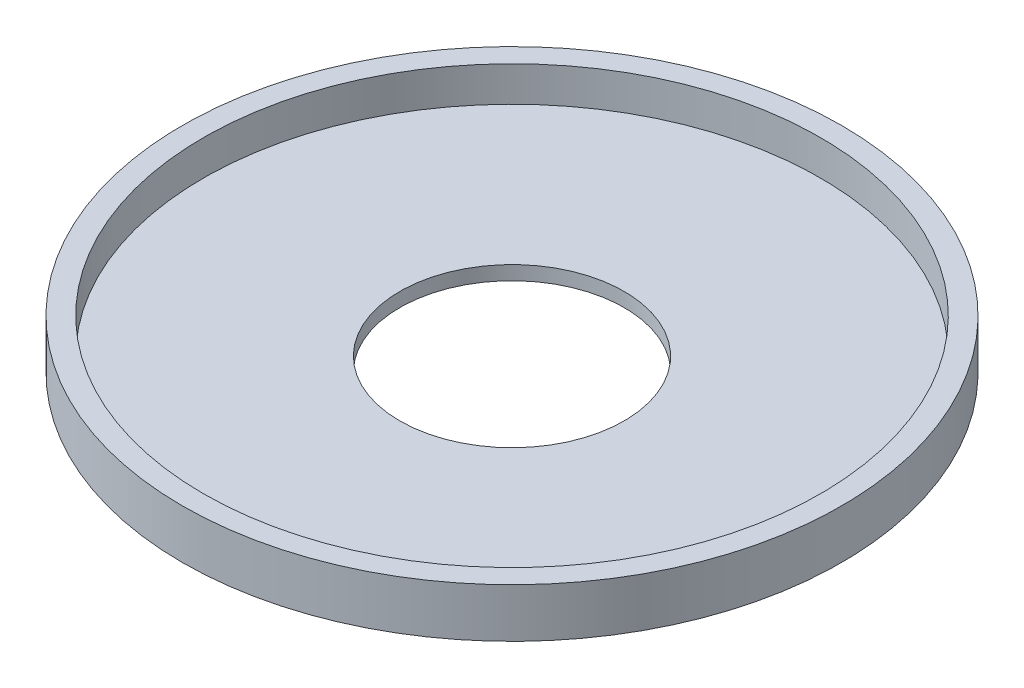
from build123d import *

# Parameters (mm, degrees)
CUT_EXTRUDE_1_DEPTH      = 1.5
SKETCH_8_R               = 1.5
CUT_EXTRUDE_3_DEPTH      = 1.5
PATTERN_CIRCULAR_2_COUNT = 12


with BuildPart() as part:
    # Sketch 1 → Revolve 1 (revolve)
    with BuildSketch(Plane(origin=(0, 0, 0), x_dir=(0, 0, -1), z_dir=(1, 0, 0)), mode=Mode.PRIVATE) as revolve_1_sk:
        Polygon((44, -6.373838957), (47, -6.373838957), (47, -13.373838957), (16, -13.373838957), (16, -11.373838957), (44, -11.373838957), align=None)
    revolve(revolve_1_sk.sketch.rotate(Axis((0, 53.982249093, 0), (0, -1, 0)), 180), axis=Axis((0, 53.982249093, 0), (0, -1, 0)))

    # Sketch 6 → Cut-Extrude 1 (cut)
    # profile 1 of 16: a face of its own
    with BuildSketch(Plane.XZ.offset(13.373838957)):
        with BuildLine():
            Line((29.143682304, 3.27337238), (29.220271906, 2.014719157))
            add(Edge.make_bspline(
                [(29.220271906, 2.014719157), (29.19228766, 2.012781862), (29.13909474, 2.009099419), (29.063328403, 2.005275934), (28.99606757, 1.998993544), (28.936630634, 1.994929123), (28.885345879, 1.98972979), (28.841809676, 1.986981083), (28.806887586, 1.981684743), (28.771405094, 1.977569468), (28.734238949, 1.968201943), (28.694241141, 1.950126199), (28.657923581, 1.925163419), (28.626802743, 1.892751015), (28.601093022, 1.854660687), (28.584722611, 1.80977082), (28.574958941, 1.759830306), (28.57637197, 1.724706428), (28.5771038, 1.706515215)],
                knots=[0, 0, 0, 0, 1.64698388, 3.130614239, 4.45340411, 5.612734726, 6.628090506, 7.479955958, 8.17213253, 8.700816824, 9.576842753, 10.409345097, 11.265982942, 12.147205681, 13.033778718, 13.942694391, 14.934488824, 16, 16, 16, 16], degree=3))
            add(Edge.make_bspline(
                [(28.5771038, 1.706515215), (28.578690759, 1.691336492), (28.581798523, 1.661611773), (28.595864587, 1.619953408), (28.616827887, 1.582711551), (28.644340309, 1.550228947), (28.678464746, 1.524866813), (28.716560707, 1.505770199), (28.758448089, 1.493590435), (28.807725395, 1.489577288), (28.869946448, 1.490559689), (28.952403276, 1.493363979), (29.058490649, 1.49933457), (29.137223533, 1.503809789), (29.180592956, 1.50627493)],
                knots=[0, 0, 0, 0, 0.757173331, 1.482783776, 2.167750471, 2.872917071, 3.582714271, 4.266826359, 4.98335009, 5.73680569, 6.715827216, 8.07805226, 9.839624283, 12, 12, 12, 12], degree=3))
            Line((29.180592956, 1.50627493), (29.983399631, 1.555181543))
            add(Edge.make_bspline(
                [(29.983399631, 1.555181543), (29.950233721, 1.569820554), (29.885237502, 1.598509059), (29.798161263, 1.659156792), (29.722552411, 1.731336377), (29.660088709, 1.817336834), (29.609114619, 1.914549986), (29.571701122, 2.024547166), (29.544600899, 2.145538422), (29.537015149, 2.230811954), (29.53308968, 2.274939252)],
                knots=[0, 0, 0, 0, 0.963642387, 1.888478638, 2.809679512, 3.735422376, 4.706453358, 5.722074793, 6.821220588, 8, 8, 8, 8], degree=3))
            add(Edge.make_bspline(
                [(29.53308968, 2.274939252), (29.532026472, 2.331303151), (29.529946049, 2.441592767), (29.555436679, 2.603779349), (29.60583298, 2.756558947), (29.678764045, 2.897499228), (29.767406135, 3.023417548), (29.871038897, 3.126749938), (29.98413456, 3.209223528), (30.112955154, 3.264957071), (30.257760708, 3.303222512), (30.421850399, 3.336927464), (30.60985135, 3.359549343), (30.74279429, 3.369581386), (30.812966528, 3.374876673)],
                knots=[0, 0, 0, 0, 1.046996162, 2.04870147, 3.036489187, 4.026676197, 4.990329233, 5.888390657, 6.737657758, 7.577605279, 8.481316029, 9.520263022, 10.691102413, 12, 12, 12, 12], degree=3))
            Line((30.812966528, 3.374876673), (31.215292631, 3.399791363))
            add(Edge.make_bspline(
                [(31.215292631, 3.399791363), (31.258043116, 3.402314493), (31.340445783, 3.407177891), (31.46008325, 3.413225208), (31.571477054, 3.415367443), (31.674512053, 3.417656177), (31.768962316, 3.417655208), (31.855111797, 3.415914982), (31.93296903, 3.412320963), (32.025374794, 3.405421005), (32.134591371, 3.387984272), (32.260484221, 3.34873918), (32.382452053, 3.292561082), (32.499562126, 3.220567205), (32.610520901, 3.132362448), (32.708234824, 3.023540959), (32.795937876, 2.898553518), (32.870802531, 2.756332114), (32.933520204, 2.598902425), (32.98227229, 2.42734462), (33.016409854, 2.242206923), (33.027461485, 2.113893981), (33.033142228, 2.047938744)],
                knots=[0, 0, 0, 0, 0.968428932, 1.866671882, 2.708558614, 3.487710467, 4.197182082, 4.844202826, 5.436083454, 5.959420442, 6.939395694, 7.92943987, 8.931650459, 9.968315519, 11.031795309, 12.124777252, 13.263288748, 14.476837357, 15.750377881, 17.088929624, 18.503655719, 20, 20, 20, 20], degree=3))
            add(Edge.make_bspline(
                [(33.033142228, 2.047938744), (33.035429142, 2.006733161), (33.039881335, 1.926513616), (33.039050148, 1.808607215), (33.036214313, 1.695885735), (33.026794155, 1.58841967), (33.012994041, 1.486166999), (32.994701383, 1.38939869), (32.971755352, 1.297816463), (32.935221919, 1.184742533), (32.879368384, 1.053922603), (32.793077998, 0.912698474), (32.69171456, 0.787490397), (32.572535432, 0.683080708), (32.444791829, 0.595726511), (32.311275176, 0.525932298), (32.173159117, 0.474179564), (32.051618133, 0.446892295), (31.944024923, 0.433274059), (31.846579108, 0.421050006), (31.732170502, 0.408932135), (31.600656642, 0.398861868), (31.452557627, 0.384933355), (31.286992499, 0.373542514), (31.104565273, 0.361676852), (30.977219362, 0.353429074), (30.910779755, 0.349125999)],
                knots=[0, 0, 0, 0, 0.92226061, 1.795468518, 2.634748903, 3.442133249, 4.205454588, 4.940377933, 5.642435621, 6.314317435, 7.595423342, 8.811170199, 10.003179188, 11.181706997, 12.339310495, 13.455646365, 14.541237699, 15.627090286, 16.230935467, 16.965215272, 17.822468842, 18.802291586, 19.913448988, 21.147432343, 22.511742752, 24, 24, 24, 24], degree=3))
            Line((30.910779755, 0.349125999), (30.209477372, 0.305755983))
            add(Edge.make_bspline(
                [(30.209477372, 0.305755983), (30.137510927, 0.301283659), (30.000066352, 0.292742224), (29.802838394, 0.28310056), (29.624463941, 0.273712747), (29.464544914, 0.265739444), (29.323312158, 0.261928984), (29.20061469, 0.257157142), (29.096315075, 0.257131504), (28.982595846, 0.25542996), (28.852809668, 0.267193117), (28.703547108, 0.302704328), (28.557006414, 0.359199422), (28.414780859, 0.434796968), (28.282183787, 0.531740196), (28.162925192, 0.646757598), (28.060436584, 0.780693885), (27.974795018, 0.932243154), (27.905157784, 1.099387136), (27.851543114, 1.280966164), (27.814661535, 1.476115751), (27.803230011, 1.6113237), (27.797366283, 1.680677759)],
                knots=[0, 0, 0, 0, 1.322346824, 2.525474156, 3.621274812, 4.598205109, 5.461733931, 6.212321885, 6.849776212, 7.374386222, 8.29774908, 9.230898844, 10.179001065, 11.17081733, 12.176128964, 13.181424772, 14.199131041, 15.257740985, 16.365110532, 17.512725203, 18.724168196, 20, 20, 20, 20], degree=3))
            add(Edge.make_bspline(
                [(27.797366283, 1.680677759), (27.795155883, 1.7240347), (27.790831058, 1.808866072), (27.790633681, 1.933607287), (27.797168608, 2.052482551), (27.809043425, 2.165540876), (27.826455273, 2.272797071), (27.849543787, 2.374501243), (27.87767238, 2.470687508), (27.912974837, 2.560673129), (27.954238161, 2.6445361), (27.99763165, 2.724425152), (28.048091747, 2.797429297), (28.102606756, 2.865050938), (28.161507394, 2.92722175), (28.226078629, 2.98261256), (28.293947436, 3.033827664), (28.367913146, 3.078133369), (28.446514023, 3.118020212), (28.530721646, 3.152581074), (28.619517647, 3.184380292), (28.713884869, 3.211021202), (28.81381765, 3.232831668), (28.919041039, 3.251452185), (29.029612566, 3.265295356), (29.105202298, 3.270647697), (29.143682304, 3.27337238)],
                knots=[0, 0, 0, 0, 1.301024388, 2.545559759, 3.736532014, 4.867590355, 5.951218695, 6.991144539, 7.991584, 8.951975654, 9.883802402, 10.791746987, 11.673912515, 12.539202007, 13.393370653, 14.236322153, 15.086301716, 15.938478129, 16.816636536, 17.7257504, 18.664618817, 19.642200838, 20.662116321, 21.729108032, 22.843970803, 24, 24, 24, 24], degree=3))
        make_face()
        with BuildLine():
            add(Edge.make_bspline(
                [(30.793588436, 2.110686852), (30.768343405, 2.109107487), (30.720209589, 2.106096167), (30.652186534, 2.097694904), (30.591841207, 2.087553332), (30.53915625, 2.076238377), (30.494439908, 2.061320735), (30.457226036, 2.044868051), (30.427002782, 2.026996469), (30.398868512, 1.999691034), (30.375693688, 1.962706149), (30.35297627, 1.91938617), (30.341533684, 1.874431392), (30.34146596, 1.844670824), (30.341432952, 1.830165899)],
                knots=[0, 0, 0, 0, 1.515838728, 2.890196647, 4.105611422, 5.183479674, 6.116303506, 6.924993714, 7.620713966, 8.207506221, 9.25579878, 10.220507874, 11.13269798, 12, 12, 12, 12], degree=3))
            add(Edge.make_bspline(
                [(30.341432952, 1.830165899), (30.343824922, 1.809646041), (30.348348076, 1.770843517), (30.370337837, 1.717965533), (30.403733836, 1.674937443), (30.450301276, 1.640201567), (30.515114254, 1.617768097), (30.599285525, 1.605366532), (30.705022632, 1.60166303), (30.782528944, 1.605019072), (30.82496249, 1.606856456)],
                knots=[0, 0, 0, 0, 0.815830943, 1.542715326, 2.237816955, 2.952324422, 3.812852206, 4.925348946, 6.316674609, 8, 8, 8, 8], degree=3))
            Line((30.82496249, 1.606856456), (31.737578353, 1.6631452))
            add(Edge.make_bspline(
                [(31.737578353, 1.6631452), (31.764047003, 1.664796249), (31.814894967, 1.667968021), (31.887158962, 1.675562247), (31.952485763, 1.683549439), (32.010048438, 1.693570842), (32.060487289, 1.70485447), (32.103686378, 1.716055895), (32.139606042, 1.730052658), (32.176605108, 1.750088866), (32.213561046, 1.780863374), (32.244179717, 1.827687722), (32.260249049, 1.883900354), (32.259997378, 1.923574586), (32.259864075, 1.944588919)],
                knots=[0, 0, 0, 0, 1.421476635, 2.730747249, 3.894458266, 4.948962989, 5.861073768, 6.665141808, 7.338761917, 7.921726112, 8.916120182, 9.881097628, 10.877676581, 12, 12, 12, 12], degree=3))
            add(Edge.make_bspline(
                [(32.259864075, 1.944588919), (32.258061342, 1.958299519), (32.254326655, 1.986703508), (32.235177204, 2.027694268), (32.207965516, 2.069113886), (32.176884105, 2.102207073), (32.14464923, 2.128910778), (32.109559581, 2.143278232), (32.067732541, 2.156582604), (32.01716192, 2.165381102), (31.958528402, 2.170369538), (31.891711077, 2.173006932), (31.816887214, 2.173189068), (31.764330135, 2.170327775), (31.736655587, 2.168821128)],
                knots=[0, 0, 0, 0, 0.777888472, 1.611536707, 2.528158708, 3.574266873, 4.169237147, 4.877500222, 5.697241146, 6.652493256, 7.77059801, 9.024060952, 10.432984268, 12, 12, 12, 12], degree=3))
            Line((31.736655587, 2.168821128), (30.793588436, 2.110686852))
        make_face(mode=Mode.SUBTRACT)
    # profile 2 of 16: a face of its own
    with BuildSketch(Plane.XZ.offset(13.373838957)):
        with BuildLine():
            add(Edge.make_bspline(
                [(27.965474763, 12.984699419), (27.967383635, 12.936091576), (27.971105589, 12.841315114), (27.954814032, 12.701516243), (27.915803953, 12.571049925), (27.869280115, 12.465886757), (27.812544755, 12.383677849), (27.748368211, 12.31934237), (27.666271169, 12.249622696), (27.564034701, 12.17692083), (27.444260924, 12.097223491), (27.304310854, 12.014330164), (27.144446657, 11.928364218), (27.031120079, 11.870112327), (26.971655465, 11.83954645)],
                knots=[0, 0, 0, 0, 1.067799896, 2.082015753, 3.07431467, 4.05084119, 4.59448851, 5.258841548, 6.040194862, 6.959339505, 8.012671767, 9.20058375, 10.531092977, 12, 12, 12, 12], degree=3))
            add(Edge.make_bspline(
                [(26.971655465, 11.83954645), (26.927134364, 11.817854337), (26.84128491, 11.776025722), (26.715591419, 11.718009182), (26.596707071, 11.669740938), (26.485750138, 11.627180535), (26.381434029, 11.594333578), (26.28464825, 11.567749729), (26.194848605, 11.550335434), (26.111344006, 11.539174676), (26.031257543, 11.537521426), (25.952204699, 11.543169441), (25.872710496, 11.555939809), (25.792953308, 11.577313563), (25.713768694, 11.607484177), (25.633573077, 11.643464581), (25.553376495, 11.687958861), (25.473149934, 11.740630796), (25.393826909, 11.801288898), (25.316583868, 11.871527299), (25.241024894, 11.950529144), (25.168642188, 12.040009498), (25.096053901, 12.136524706), (25.027123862, 12.243767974), (24.95876944, 12.359194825), (24.916843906, 12.440956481), (24.895431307, 12.482714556)],
                knots=[0, 0, 0, 0, 1.400098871, 2.699792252, 3.912508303, 5.026936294, 6.058198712, 7.003142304, 7.862643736, 8.642440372, 9.381770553, 10.122735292, 10.880400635, 11.654504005, 12.452416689, 13.273540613, 14.137560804, 15.041986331, 15.984646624, 16.95738802, 17.990664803, 19.071754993, 20.209150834, 21.403015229, 22.673643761, 24, 24, 24, 24], degree=3))
            add(Edge.make_bspline(
                [(24.895431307, 12.482714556), (24.875339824, 12.52374529), (24.836150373, 12.603777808), (24.785589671, 12.723980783), (24.742511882, 12.839826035), (24.710051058, 12.952139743), (24.681973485, 13.059138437), (24.664689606, 13.162924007), (24.655139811, 13.262537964), (24.654140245, 13.35824147), (24.661069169, 13.450055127), (24.672642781, 13.538288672), (24.690551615, 13.623006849), (24.712940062, 13.704179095), (24.743216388, 13.781306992), (24.77806566, 13.855171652), (24.81876326, 13.925788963), (24.866791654, 13.993564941), (24.924450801, 14.060374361), (24.993960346, 14.127613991), (25.076797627, 14.195736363), (25.172133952, 14.265720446), (25.280073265, 14.33769195), (25.401503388, 14.410190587), (25.535079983, 14.485214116), (25.629761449, 14.533155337), (25.678859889, 14.558015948)],
                knots=[0, 0, 0, 0, 1.268587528, 2.474443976, 3.620316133, 4.698765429, 5.720219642, 6.690674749, 7.617235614, 8.497177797, 9.345019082, 10.172605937, 10.966757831, 11.748265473, 12.508183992, 13.264782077, 14.01498708, 14.768734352, 15.568380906, 16.46247415, 17.451255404, 18.544757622, 19.746005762, 21.052847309, 22.471711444, 24, 24, 24, 24], degree=3))
            add(Edge.make_bspline(
                [(25.678859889, 14.558015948), (25.745592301, 14.590699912), (25.874361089, 14.653767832), (26.066026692, 14.733853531), (26.247178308, 14.800472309), (26.392663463, 14.847079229), (26.506823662, 14.870441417), (26.591662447, 14.878392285), (26.676879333, 14.874188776), (26.76279035, 14.860489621), (26.848461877, 14.834801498), (26.935236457, 14.800562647), (27.022014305, 14.755187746), (27.077786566, 14.718174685), (27.106379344, 14.699199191)],
                knots=[0, 0, 0, 0, 1.753445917, 3.383499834, 4.899336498, 6.309482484, 6.982900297, 7.646066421, 8.31457516, 8.991271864, 9.694286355, 10.420893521, 11.19043911, 12, 12, 12, 12], degree=3))
            add(Edge.make_bspline(
                [(27.106379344, 14.699199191), (27.107459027, 14.741859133), (27.109593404, 14.82619171), (27.142553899, 14.949186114), (27.193084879, 15.067039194), (27.267974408, 15.178198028), (27.364701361, 15.282337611), (27.480817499, 15.382770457), (27.619514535, 15.475879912), (27.721933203, 15.530032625), (27.775384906, 15.55829461)],
                knots=[0, 0, 0, 0, 0.886287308, 1.75206271, 2.633144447, 3.548542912, 4.528433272, 5.587120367, 6.740732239, 8, 8, 8, 8], degree=3))
            add(Edge.make_bspline(
                [(27.775384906, 15.55829461), (27.823054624, 15.580842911), (27.915777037, 15.624701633), (28.055990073, 15.676841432), (28.192683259, 15.712854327), (28.325108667, 15.73622756), (28.453941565, 15.742134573), (28.578899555, 15.73569317), (28.699313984, 15.711916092), (28.815963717, 15.674938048), (28.928334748, 15.622585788), (29.036735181, 15.555750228), (29.140587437, 15.473847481), (29.239221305, 15.376884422), (29.335000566, 15.266401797), (29.425662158, 15.14065459), (29.512959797, 15.000687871), (29.565299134, 14.900430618), (29.592311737, 14.84868733)],
                knots=[0, 0, 0, 0, 1.13177878, 2.201423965, 3.205682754, 4.163154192, 5.082169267, 5.968580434, 6.842732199, 7.709369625, 8.589783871, 9.49693218, 10.437472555, 11.422774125, 12.462026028, 13.572805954, 14.747312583, 16, 16, 16, 16], degree=3))
            add(Edge.make_bspline(
                [(29.592311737, 14.84868733), (29.621396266, 14.788442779), (29.677382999, 14.672474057), (29.745476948, 14.499714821), (29.798474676, 14.336970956), (29.832891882, 14.183091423), (29.85153926, 14.03874745), (29.851803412, 13.903550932), (29.835725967, 13.777645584), (29.801881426, 13.660664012), (29.752616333, 13.55161809), (29.691697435, 13.447672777), (29.616571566, 13.349355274), (29.529937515, 13.254907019), (29.429323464, 13.166577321), (29.31699103, 13.081974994), (29.191400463, 13.002867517), (29.101429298, 12.95549009), (29.055261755, 12.931178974)],
                knots=[0, 0, 0, 0, 1.392805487, 2.681103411, 3.864247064, 4.953730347, 5.960444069, 6.889307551, 7.761764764, 8.595056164, 9.415243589, 10.248017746, 11.098732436, 11.987291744, 12.912946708, 13.882809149, 14.913590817, 16, 16, 16, 16], degree=3))
            add(Edge.make_bspline(
                [(29.055261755, 12.931178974), (29.025495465, 12.916885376), (28.96816756, 12.889356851), (28.884176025, 12.851888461), (28.804776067, 12.821820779), (28.730610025, 12.79606973), (28.660873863, 12.777654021), (28.595762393, 12.765573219), (28.535934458, 12.758583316), (28.479561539, 12.758374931), (28.424191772, 12.765312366), (28.367226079, 12.778628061), (28.306935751, 12.797018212), (28.244123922, 12.822293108), (28.178481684, 12.853757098), (28.110324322, 12.892239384), (28.03809797, 12.935140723), (27.990214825, 12.967816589), (27.965474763, 12.984699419)],
                knots=[0, 0, 0, 0, 1.349995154, 2.600001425, 3.758345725, 4.820104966, 5.808351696, 6.703660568, 7.525768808, 8.267700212, 9.002349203, 9.801635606, 10.656835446, 11.576883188, 12.56680864, 13.630650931, 14.775814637, 16, 16, 16, 16], degree=3))
        make_face()
        with BuildLine():
            add(Edge.make_bspline(
                [(28.620638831, 14.106783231), (28.655219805, 14.124959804), (28.718133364, 14.158028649), (28.801392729, 14.206456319), (28.861033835, 14.252797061), (28.903520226, 14.294443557), (28.925739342, 14.339635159), (28.932404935, 14.387790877), (28.922488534, 14.439712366), (28.908039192, 14.473391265), (28.900237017, 14.491576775)],
                knots=[0, 0, 0, 0, 1.71673303, 3.123271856, 4.220602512, 5.033192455, 5.70997246, 6.392125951, 7.131800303, 8, 8, 8, 8], degree=3))
            add(Edge.make_bspline(
                [(28.900237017, 14.491576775), (28.890930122, 14.508470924), (28.873398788, 14.540294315), (28.835596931, 14.576686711), (28.79172175, 14.598554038), (28.740745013, 14.604766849), (28.681418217, 14.595082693), (28.609521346, 14.573746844), (28.52293713, 14.539065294), (28.461401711, 14.508952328), (28.427780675, 14.492499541)],
                knots=[0, 0, 0, 0, 0.854584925, 1.609775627, 2.295397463, 3.000021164, 3.85570157, 4.951838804, 6.334579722, 8, 8, 8, 8], degree=3))
            Line((28.427780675, 14.492499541), (28.083588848, 14.319942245))
            add(Edge.make_bspline(
                [(28.083588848, 14.319942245), (28.052245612, 14.303834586), (27.994560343, 14.274189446), (27.919521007, 14.226671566), (27.862555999, 14.181354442), (27.822306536, 14.137558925), (27.79877515, 14.091780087), (27.792998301, 14.043798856), (27.798024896, 13.993196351), (27.812779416, 13.961289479), (27.820600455, 13.944376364)],
                knots=[0, 0, 0, 0, 1.618937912, 2.979554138, 4.074580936, 4.956213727, 5.695869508, 6.395543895, 7.149513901, 8, 8, 8, 8], degree=3))
            add(Edge.make_bspline(
                [(27.820600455, 13.944376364), (27.830000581, 13.927567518), (27.847491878, 13.896290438), (27.883582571, 13.859158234), (27.925896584, 13.83673693), (27.975994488, 13.828961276), (28.036479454, 13.83942091), (28.111946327, 13.862460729), (28.205642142, 13.900169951), (28.272675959, 13.932819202), (28.30966659, 13.950835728)],
                knots=[0, 0, 0, 0, 0.824467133, 1.534128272, 2.189761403, 2.845394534, 3.670918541, 4.799190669, 6.233727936, 8, 8, 8, 8], degree=3))
            Line((28.30966659, 13.950835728), (28.620638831, 14.106783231))
        make_face(mode=Mode.SUBTRACT)
        with BuildLine():
            add(Edge.make_bspline(
                [(26.750191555, 13.140646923), (26.789595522, 13.160944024), (26.86147436, 13.19796903), (26.954215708, 13.256476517), (27.022484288, 13.310317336), (27.06834499, 13.362121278), (27.091921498, 13.415139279), (27.099745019, 13.468819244), (27.091597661, 13.524508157), (27.076500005, 13.559567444), (27.068545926, 13.578038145)],
                knots=[0, 0, 0, 0, 1.73156529, 3.158638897, 4.27751684, 5.122417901, 5.832707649, 6.512652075, 7.216402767, 8, 8, 8, 8], degree=3))
            add(Edge.make_bspline(
                [(27.068545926, 13.578038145), (27.059187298, 13.594892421), (27.041242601, 13.627209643), (27.002701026, 13.66510087), (26.95693987, 13.689639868), (26.902482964, 13.700069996), (26.835316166, 13.693226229), (26.751855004, 13.669202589), (26.648812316, 13.627733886), (26.574917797, 13.591508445), (26.534264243, 13.571578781)],
                knots=[0, 0, 0, 0, 0.7592295, 1.455784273, 2.103153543, 2.785227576, 3.614375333, 4.747067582, 6.21037791, 8, 8, 8, 8], degree=3))
            Line((26.534264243, 13.571578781), (25.946462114, 13.277216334))
            add(Edge.make_bspline(
                [(25.946462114, 13.277216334), (25.923382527, 13.265249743), (25.879167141, 13.242324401), (25.816245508, 13.209153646), (25.76222286, 13.174818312), (25.713186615, 13.145780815), (25.674277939, 13.114249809), (25.640037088, 13.087641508), (25.615092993, 13.060240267), (25.590474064, 13.028239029), (25.572067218, 12.985402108), (25.565909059, 12.931462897), (25.573396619, 12.874751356), (25.589278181, 12.839201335), (25.597656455, 12.820447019)],
                knots=[0, 0, 0, 0, 1.432442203, 2.744242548, 3.915421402, 4.959028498, 5.877512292, 6.671587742, 7.343009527, 7.912376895, 8.891390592, 9.864520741, 10.873433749, 12, 12, 12, 12], degree=3))
            add(Edge.make_bspline(
                [(25.597656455, 12.820447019), (25.607914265, 12.802369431), (25.62710271, 12.768553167), (25.666855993, 12.728303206), (25.714089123, 12.705441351), (25.757819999, 12.698755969), (25.796650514, 12.703057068), (25.832272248, 12.710878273), (25.874411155, 12.721794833), (25.921944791, 12.738824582), (25.975707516, 12.76027389), (26.035457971, 12.786007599), (26.101175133, 12.816738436), (26.146741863, 12.839128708), (26.170694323, 12.850898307)],
                knots=[0, 0, 0, 0, 1.144204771, 2.140370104, 3.066402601, 3.992901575, 4.538391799, 5.214087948, 6.00452372, 6.938454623, 7.997413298, 9.198605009, 10.527427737, 12, 12, 12, 12], degree=3))
            Line((26.170694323, 12.850898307), (26.750191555, 13.140646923))
        make_face(mode=Mode.SUBTRACT)
    # profile 3 of 16: a face of its own
    with BuildSketch(Plane.XZ.offset(13.373838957)):
        Polygon((22.637418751, 24.038611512), (21.916738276, 23.214581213), (18.723966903, 20.78586033), (17.785513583, 21.60712233), (21.171143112, 24.123506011), (20.239149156, 24.939231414), (20.833410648, 25.618387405), align=None)
    # profile 4 of 16: a face of its own
    with BuildSketch(Plane.XZ.offset(13.373838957)):
        with BuildLine():
            Line((11.769678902, 29.418214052), (10.582078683, 29.827922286))
            add(Edge.make_bspline(
                [(10.582078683, 29.827922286), (10.590916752, 29.854402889), (10.607792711, 29.9049666), (10.633024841, 29.976317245), (10.654146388, 30.040435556), (10.67272675, 30.096685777), (10.688265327, 30.145636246), (10.701587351, 30.186650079), (10.710324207, 30.220498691), (10.720867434, 30.254320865), (10.727371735, 30.292383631), (10.726583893, 30.336249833), (10.717057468, 30.37890348), (10.699150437, 30.419278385), (10.674708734, 30.458160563), (10.639143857, 30.490019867), (10.597277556, 30.51908753), (10.564303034, 30.531185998), (10.547013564, 30.537529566)],
                knots=[0, 0, 0, 0, 1.644693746, 3.140480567, 4.458519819, 5.621846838, 6.630498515, 7.48453178, 8.161616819, 8.689330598, 9.57117377, 10.423089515, 11.258461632, 12.126983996, 13.016613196, 13.939578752, 14.919663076, 16, 16, 16, 16], degree=3))
            add(Edge.make_bspline(
                [(10.547013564, 30.537529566), (10.532043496, 30.541678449), (10.50337176, 30.549624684), (10.459276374, 30.553928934), (10.416740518, 30.548320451), (10.37685955, 30.533748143), (10.339282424, 30.51421972), (10.308060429, 30.485107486), (10.279421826, 30.452088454), (10.256603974, 30.408411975), (10.23258581, 30.351477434), (10.204909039, 30.274133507), (10.16714729, 30.175128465), (10.141940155, 30.100550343), (10.128077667, 30.059536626)],
                knots=[0, 0, 0, 0, 0.772842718, 1.480203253, 2.190873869, 2.888546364, 3.587898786, 4.282537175, 5.00043625, 5.754838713, 6.722401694, 8.079721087, 9.844070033, 12, 12, 12, 12], degree=3))
            Line((10.128077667, 30.059536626), (9.866934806, 29.301022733))
            add(Edge.make_bspline(
                [(9.866934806, 29.301022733), (9.893595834, 29.325892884), (9.945691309, 29.374488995), (10.035165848, 29.431691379), (10.131222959, 29.472813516), (10.234155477, 29.49743913), (10.343265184, 29.508061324), (10.458303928, 29.500226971), (10.579532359, 29.479299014), (10.660156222, 29.453672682), (10.702038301, 29.440360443)],
                knots=[0, 0, 0, 0, 0.973050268, 1.901333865, 2.822269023, 3.753570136, 4.719822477, 5.741011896, 6.826512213, 8, 8, 8, 8], degree=3))
            add(Edge.make_bspline(
                [(10.702038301, 29.440360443), (10.75445075, 29.420101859), (10.857035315, 29.380450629), (10.996379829, 29.294849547), (11.117856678, 29.190157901), (11.219953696, 29.069034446), (11.301671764, 28.939285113), (11.358605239, 28.804682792), (11.390580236, 28.668778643), (11.392640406, 28.528375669), (11.373520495, 28.380379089), (11.340975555, 28.21661612), (11.291154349, 28.034484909), (11.24925148, 27.908061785), (11.227092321, 27.841206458)],
                knots=[0, 0, 0, 0, 1.046018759, 2.047326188, 3.031437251, 4.024266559, 4.990262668, 5.879656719, 6.738113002, 7.575760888, 8.482079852, 9.516859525, 10.686860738, 12, 12, 12, 12], degree=3))
            Line((11.227092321, 27.841206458), (11.096059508, 27.461949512))
            add(Edge.make_bspline(
                [(11.096059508, 27.461949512), (11.081937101, 27.421647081), (11.054622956, 27.34369816), (11.014672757, 27.231059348), (10.973990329, 27.127701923), (10.938081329, 27.031712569), (10.90170132, 26.944476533), (10.866754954, 26.865944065), (10.834667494, 26.795091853), (10.793133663, 26.712745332), (10.736174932, 26.61883519), (10.652531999, 26.517634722), (10.554007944, 26.427369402), (10.442481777, 26.346669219), (10.317572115, 26.280153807), (10.180448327, 26.229657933), (10.031557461, 26.198456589), (9.872620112, 26.181374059), (9.704224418, 26.183924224), (9.528454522, 26.204774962), (9.345515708, 26.243605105), (9.223762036, 26.282771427), (9.161018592, 26.302955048)],
                knots=[0, 0, 0, 0, 0.96954673, 1.875200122, 2.712969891, 3.491077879, 4.201744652, 4.858305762, 5.442596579, 5.967260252, 6.951755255, 7.929016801, 8.937103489, 9.977798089, 11.046214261, 12.139801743, 13.283519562, 14.491174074, 15.762177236, 17.097833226, 18.504423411, 20, 20, 20, 20], degree=3))
            add(Edge.make_bspline(
                [(9.161018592, 26.302955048), (9.122162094, 26.316838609), (9.046134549, 26.344003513), (8.936149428, 26.38838578), (8.83287827, 26.434670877), (8.73773133, 26.485679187), (8.647787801, 26.535422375), (8.565398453, 26.589394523), (8.489807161, 26.645374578), (8.399473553, 26.72224638), (8.301036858, 26.824177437), (8.203439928, 26.956947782), (8.127371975, 27.097974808), (8.076716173, 27.247104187), (8.045159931, 27.398149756), (8.033421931, 27.548199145), (8.038465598, 27.695414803), (8.059126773, 27.818095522), (8.087662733, 27.922457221), (8.112485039, 28.017358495), (8.147074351, 28.127214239), (8.184678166, 28.253569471), (8.232048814, 28.394785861), (8.283059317, 28.552587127), (8.341406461, 28.726003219), (8.382759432, 28.846734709), (8.404350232, 28.909769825)],
                knots=[0, 0, 0, 0, 0.92323613, 1.806425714, 2.653473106, 3.453936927, 4.221437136, 4.952616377, 5.656056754, 6.324976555, 7.605219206, 8.816692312, 10.002175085, 11.175446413, 12.328249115, 13.446867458, 14.53515354, 15.616912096, 16.221239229, 16.955908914, 17.811636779, 18.797914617, 19.905809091, 21.144295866, 22.509008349, 24, 24, 24, 24], degree=3))
            Line((8.404350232, 28.909769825), (8.630427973, 29.568624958))
            add(Edge.make_bspline(
                [(8.630427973, 29.568624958), (8.654044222, 29.636625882), (8.699171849, 29.766566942), (8.764869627, 29.952288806), (8.824687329, 30.119982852), (8.878958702, 30.269963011), (8.929001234, 30.401727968), (8.97283611, 30.516032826), (9.011943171, 30.612172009), (9.054996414, 30.717097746), (9.115807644, 30.831980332), (9.204952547, 30.956951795), (9.313640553, 31.069800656), (9.437183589, 31.172208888), (9.576044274, 31.257925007), (9.727379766, 31.323220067), (9.889563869, 31.367012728), (10.062255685, 31.387165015), (10.243023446, 31.387955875), (10.430920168, 31.367642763), (10.625173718, 31.328356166), (10.754064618, 31.286865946), (10.820152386, 31.265592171)],
                knots=[0, 0, 0, 0, 1.323779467, 2.529573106, 3.622733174, 4.597959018, 5.462582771, 6.214699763, 6.849131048, 7.371274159, 8.299932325, 9.232338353, 10.184573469, 11.173175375, 12.176299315, 13.174531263, 14.194027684, 15.254141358, 16.362820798, 17.511582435, 18.724083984, 20, 20, 20, 20], degree=3))
            add(Edge.make_bspline(
                [(10.820152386, 31.265592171), (10.860936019, 31.251300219), (10.940495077, 31.223420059), (11.054280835, 31.174558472), (11.161171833, 31.124502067), (11.260672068, 31.070555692), (11.353037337, 31.013596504), (11.437907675, 30.952936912), (11.514880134, 30.888635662), (11.58528991, 30.822476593), (11.64803055, 30.753188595), (11.703789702, 30.681598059), (11.752979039, 30.608276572), (11.793495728, 30.531854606), (11.827941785, 30.453912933), (11.856051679, 30.373888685), (11.875078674, 30.290847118), (11.888009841, 30.206020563), (11.894555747, 30.118399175), (11.894045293, 30.027779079), (11.888920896, 29.934045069), (11.876202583, 29.837110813), (11.858840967, 29.737012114), (11.835616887, 29.633195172), (11.806291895, 29.526249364), (11.782044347, 29.454701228), (11.769678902, 29.418214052)],
                knots=[0, 0, 0, 0, 1.299521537, 2.535053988, 3.72282776, 4.848892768, 5.93750384, 6.985080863, 7.983711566, 8.952317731, 9.888979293, 10.792141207, 11.680008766, 12.541004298, 13.390237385, 14.241685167, 15.087737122, 15.948732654, 16.820841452, 17.727550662, 18.672899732, 19.642609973, 20.666299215, 21.728039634, 22.841375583, 24, 24, 24, 24], degree=3))
        make_face()
        with BuildLine():
            add(Edge.make_bspline(
                [(10.070866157, 28.342268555), (10.083925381, 28.381428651), (10.107758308, 28.452895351), (10.130065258, 28.553696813), (10.141529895, 28.636675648), (10.136833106, 28.705211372), (10.117853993, 28.760601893), (10.085941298, 28.806407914), (10.039742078, 28.842249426), (10.002737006, 28.857452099), (9.983203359, 28.865477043)],
                knots=[0, 0, 0, 0, 1.64280096, 2.998091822, 4.107391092, 4.968046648, 5.708041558, 6.411546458, 7.161512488, 8, 8, 8, 8], degree=3))
            add(Edge.make_bspline(
                [(9.983203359, 28.865477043), (9.96369948, 28.870906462), (9.926390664, 28.881292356), (9.869181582, 28.883377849), (9.81687606, 28.867261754), (9.767112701, 28.837936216), (9.72206473, 28.787026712), (9.678321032, 28.714847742), (9.633474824, 28.619573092), (9.607823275, 28.546487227), (9.593795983, 28.506520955)],
                knots=[0, 0, 0, 0, 0.805371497, 1.540588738, 2.242378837, 2.956782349, 3.814854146, 4.916164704, 6.313635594, 8, 8, 8, 8], degree=3))
            Line((9.593795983, 28.506520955), (9.296665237, 27.644657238))
            add(Edge.make_bspline(
                [(9.296665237, 27.644657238), (9.288287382, 27.619460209), (9.272296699, 27.571367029), (9.250528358, 27.502065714), (9.234343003, 27.438766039), (9.221070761, 27.381919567), (9.211345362, 27.331200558), (9.206858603, 27.28641685), (9.205581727, 27.247830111), (9.208608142, 27.205635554), (9.223556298, 27.159846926), (9.256033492, 27.114502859), (9.300364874, 27.077034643), (9.337304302, 27.062578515), (9.356645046, 27.055009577)],
                knots=[0, 0, 0, 0, 1.425729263, 2.721267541, 3.898919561, 4.932509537, 5.855711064, 6.669134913, 7.346440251, 7.926575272, 8.934515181, 9.882926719, 10.891542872, 12, 12, 12, 12], degree=3))
            add(Edge.make_bspline(
                [(9.356645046, 27.055009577), (9.370079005, 27.051191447), (9.397806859, 27.04331078), (9.443303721, 27.045829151), (9.49168685, 27.055345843), (9.534961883, 27.069838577), (9.570921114, 27.090692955), (9.597606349, 27.117182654), (9.625919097, 27.150615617), (9.652453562, 27.194150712), (9.680696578, 27.24576179), (9.708968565, 27.306079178), (9.736217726, 27.375781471), (9.754155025, 27.425000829), (9.763584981, 27.450876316)],
                knots=[0, 0, 0, 0, 0.786257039, 1.622844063, 2.545552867, 3.581724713, 4.191354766, 4.881794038, 5.698361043, 6.669957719, 7.761638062, 9.032238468, 10.43979523, 12, 12, 12, 12], degree=3))
            Line((9.763584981, 27.450876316), (10.070866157, 28.342268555))
        make_face(mode=Mode.SUBTRACT)
    # profile 5 of 16: a face of its own
    with BuildSketch(Plane.XZ.offset(13.373838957)):
        with BuildLine():
            Line((-1.093223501, 33.009238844), (-1.035089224, 32.202741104))
            Line((-1.035089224, 32.202741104), (-2.595487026, 32.091086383))
            Line((-2.595487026, 32.091086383), (-2.533661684, 31.234759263))
            add(Edge.make_bspline(
                [(-2.533661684, 31.234759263), (-2.510915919, 31.264212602), (-2.466349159, 31.321921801), (-2.389599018, 31.398162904), (-2.307073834, 31.464197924), (-2.218299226, 31.519853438), (-2.123318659, 31.564268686), (-2.022791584, 31.598583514), (-1.916069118, 31.622992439), (-1.842319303, 31.630490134), (-1.804676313, 31.634317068)],
                knots=[0, 0, 0, 0, 1.038023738, 2.033844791, 3.011506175, 3.983645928, 4.95168092, 5.932016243, 6.94447065, 8, 8, 8, 8], degree=3))
            add(Edge.make_bspline(
                [(-1.804676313, 31.634317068), (-1.762544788, 31.63661862), (-1.68072551, 31.641088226), (-1.561261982, 31.635006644), (-1.448999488, 31.620944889), (-1.344196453, 31.595880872), (-1.246526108, 31.561475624), (-1.15547475, 31.518634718), (-1.072513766, 31.463980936), (-0.995598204, 31.399955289), (-0.925569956, 31.321685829), (-0.865113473, 31.225798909), (-0.810677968, 31.113889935), (-0.765071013, 30.983906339), (-0.726102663, 30.837253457), (-0.692648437, 30.673439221), (-0.668464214, 30.492087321), (-0.65773841, 30.365258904), (-0.652141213, 30.299074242)],
                knots=[0, 0, 0, 0, 0.99160883, 1.925701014, 2.808537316, 3.648897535, 4.454158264, 5.240318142, 6.008707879, 6.78387666, 7.588194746, 8.466962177, 9.440681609, 10.509165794, 11.700560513, 13.007050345, 14.438146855, 16, 16, 16, 16], degree=3))
            Line((-0.652141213, 30.299074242), (-0.600466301, 29.579316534))
            add(Edge.make_bspline(
                [(-0.600466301, 29.579316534), (-0.597593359, 29.536260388), (-0.592033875, 29.452941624), (-0.585694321, 29.332352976), (-0.580722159, 29.220401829), (-0.578758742, 29.117323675), (-0.579801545, 29.02286645), (-0.582485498, 28.937334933), (-0.58670268, 28.860336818), (-0.596394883, 28.769758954), (-0.616423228, 28.663299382), (-0.655347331, 28.540406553), (-0.710671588, 28.421848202), (-0.779523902, 28.307212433), (-0.864443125, 28.199244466), (-0.968033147, 28.102521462), (-1.089927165, 28.018594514), (-1.22784894, 27.944198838), (-1.384369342, 27.884023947), (-1.557524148, 27.835037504), (-1.748535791, 27.800232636), (-1.88205998, 27.788078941), (-1.951396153, 27.781767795)],
                knots=[0, 0, 0, 0, 0.981502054, 1.899323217, 2.746596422, 3.530305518, 4.243961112, 4.894954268, 5.476698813, 5.997440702, 6.966167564, 7.935298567, 8.921378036, 9.935260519, 10.97108914, 12.035283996, 13.145491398, 14.328691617, 15.59151662, 16.951354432, 18.41690545, 20, 20, 20, 20], degree=3))
            add(Edge.make_bspline(
                [(-1.951396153, 27.781767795), (-2.030129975, 27.778419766), (-2.183454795, 27.771899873), (-2.408513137, 27.78741049), (-2.620570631, 27.826572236), (-2.788126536, 27.875626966), (-2.912567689, 27.928008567), (-2.999360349, 27.971741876), (-3.079250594, 28.022336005), (-3.153718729, 28.077398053), (-3.220684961, 28.13962611), (-3.282576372, 28.206304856), (-3.336793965, 28.279608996), (-3.385906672, 28.35927075), (-3.428251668, 28.448345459), (-3.46699082, 28.547656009), (-3.502206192, 28.658839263), (-3.531700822, 28.7820754), (-3.558713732, 28.916858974), (-3.581634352, 29.063379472), (-3.59978048, 29.221963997), (-3.608696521, 29.331678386), (-3.613298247, 29.388303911)],
                knots=[0, 0, 0, 0, 1.755282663, 3.418205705, 5.014112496, 6.553749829, 7.297223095, 8.020709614, 8.716789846, 9.402258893, 10.081461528, 10.750979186, 11.426853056, 12.109884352, 12.833403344, 13.62133503, 14.484155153, 15.430127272, 16.443741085, 17.547026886, 18.733977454, 20, 20, 20, 20], degree=3))
            Line((-3.613298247, 29.388303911), (-3.632676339, 29.6623655))
            Line((-3.632676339, 29.6623655), (-2.374945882, 29.752796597))
            Line((-2.374945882, 29.752796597), (-2.352799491, 29.438133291))
            add(Edge.make_bspline(
                [(-2.352799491, 29.438133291), (-2.349751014, 29.398760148), (-2.343890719, 29.323070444), (-2.335015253, 29.21411765), (-2.324645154, 29.114500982), (-2.31448751, 29.023758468), (-2.304555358, 28.941559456), (-2.293942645, 28.868232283), (-2.281376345, 28.804087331), (-2.270280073, 28.748227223), (-2.255604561, 28.699983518), (-2.236398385, 28.658448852), (-2.211370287, 28.624224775), (-2.181934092, 28.596212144), (-2.147282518, 28.575630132), (-2.107547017, 28.562935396), (-2.06357484, 28.5563509), (-2.032926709, 28.557312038), (-2.01691256, 28.557814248)],
                knots=[0, 0, 0, 0, 1.812360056, 3.484024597, 5.016445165, 6.408505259, 7.674393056, 8.816310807, 9.807454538, 10.67406963, 11.428585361, 12.116806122, 12.763376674, 13.362602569, 13.970248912, 14.595193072, 15.265965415, 16, 16, 16, 16], degree=3))
            add(Edge.make_bspline(
                [(-2.01691256, 28.557814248), (-2.002026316, 28.559346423), (-1.973453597, 28.562287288), (-1.933490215, 28.57667842), (-1.898836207, 28.598352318), (-1.860436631, 28.63445885), (-1.827539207, 28.688428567), (-1.815953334, 28.745074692), (-1.819096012, 28.788797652), (-1.819026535, 28.827606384), (-1.822909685, 28.880752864), (-1.824717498, 28.94818561), (-1.829982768, 29.029652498), (-1.83559427, 29.125289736), (-1.840601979, 29.235469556), (-1.845462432, 29.313566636), (-1.848046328, 29.355084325)],
                knots=[0, 0, 0, 0, 0.69032961, 1.325021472, 1.945024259, 2.569259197, 3.750545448, 4.808365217, 5.178653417, 5.776538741, 6.603059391, 7.642823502, 8.89720055, 10.379720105, 12.075399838, 14, 14, 14, 14], degree=3))
            Line((-1.848046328, 29.355084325), (-1.920022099, 30.35444022))
            add(Edge.make_bspline(
                [(-1.920022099, 30.35444022), (-1.923728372, 30.39786955), (-1.930513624, 30.477377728), (-1.948021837, 30.585164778), (-1.972056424, 30.670068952), (-2.002085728, 30.735025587), (-2.042444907, 30.780303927), (-2.09019912, 30.811688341), (-2.148381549, 30.826176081), (-2.189107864, 30.825440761), (-2.210693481, 30.825051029)],
                knots=[0, 0, 0, 0, 1.663984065, 3.04633621, 4.161046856, 5.02760697, 5.751242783, 6.448379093, 7.177615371, 8, 8, 8, 8], degree=3))
            add(Edge.make_bspline(
                [(-2.210693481, 30.825051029), (-2.224597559, 30.823292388), (-2.251633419, 30.819872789), (-2.290349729, 30.808263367), (-2.324321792, 30.787783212), (-2.362876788, 30.754912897), (-2.399232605, 30.707000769), (-2.422881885, 30.650894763), (-2.427814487, 30.595338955), (-2.426324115, 30.534695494), (-2.425509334, 30.453997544), (-2.420879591, 30.393485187), (-2.418315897, 30.359976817)],
                knots=[0, 0, 0, 0, 0.72267228, 1.40520407, 2.066562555, 2.753324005, 4.01014858, 5.135808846, 5.838518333, 6.86997355, 8.266765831, 10, 10, 10, 10], degree=3))
            Line((-2.418315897, 30.359976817), (-3.664050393, 30.270468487))
            Line((-3.664050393, 30.270468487), (-3.793237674, 32.815457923))
            Line((-3.793237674, 32.815457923), (-1.093223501, 33.009238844))
        make_face()
    # profile 6 of 16: a face of its own
    with BuildSketch(Plane.XZ.offset(13.373838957)):
        Polygon((-13.910114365, 29.933419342), (-12.417078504, 27.004559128), (-12.098724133, 27.166965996), (-11.709316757, 26.402915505), (-12.027671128, 26.240508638), (-11.625345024, 25.451543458), (-12.743737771, 24.881273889), (-13.146063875, 25.670239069), (-14.474847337, 24.99292861), (-14.864254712, 25.7569791), (-15.391154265, 29.178596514), align=None)
        Polygon((-13.535471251, 26.434289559), (-14.508066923, 28.341647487), (-14.028228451, 26.183297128), align=None, mode=Mode.SUBTRACT)
    # profile 7 of 16: a face of its own
    with BuildSketch(Plane.XZ.offset(13.373838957)):
        with BuildLine():
            add(Edge.make_bspline(
                [(-22.945588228, 20.547543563), (-22.903490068, 20.57079043), (-22.821645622, 20.615985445), (-22.691032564, 20.658741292), (-22.560563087, 20.677788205), (-22.449842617, 20.674056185), (-22.35597556, 20.653385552), (-22.274561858, 20.620447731), (-22.182801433, 20.572434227), (-22.078626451, 20.511525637), (-21.96526426, 20.433048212), (-21.839119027, 20.341460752), (-21.701877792, 20.234699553), (-21.608529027, 20.156014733), (-21.559593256, 20.114766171)],
                knots=[0, 0, 0, 0, 1.093811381, 2.126515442, 3.110640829, 4.085641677, 4.631401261, 5.292522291, 6.079184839, 6.990207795, 8.039798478, 9.218642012, 10.541942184, 12, 12, 12, 12], degree=3))
            add(Edge.make_bspline(
                [(-21.559593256, 20.114766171), (-21.522767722, 20.083338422), (-21.451172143, 20.022237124), (-21.350494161, 19.928981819), (-21.259346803, 19.837626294), (-21.17625091, 19.749124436), (-21.104177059, 19.661527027), (-21.039215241, 19.577394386), (-20.98514985, 19.494429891), (-20.938884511, 19.41335419), (-20.901757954, 19.332378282), (-20.871896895, 19.250665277), (-20.849602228, 19.167662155), (-20.835505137, 19.082677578), (-20.830338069, 18.996129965), (-20.832273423, 18.907885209), (-20.841226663, 18.8182691), (-20.859484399, 18.727433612), (-20.883836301, 18.635239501), (-20.918033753, 18.54252289), (-20.958337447, 18.448238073), (-21.007531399, 18.353052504), (-21.065332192, 18.257133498), (-21.129513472, 18.159511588), (-21.202048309, 18.061066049), (-21.254782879, 17.996781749), (-21.281840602, 17.963797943)],
                knots=[0, 0, 0, 0, 1.379248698, 2.68151194, 3.908470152, 5.05569086, 6.138475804, 7.139285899, 8.082374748, 8.957413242, 9.79656511, 10.617161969, 11.433442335, 12.241685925, 13.067135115, 13.899855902, 14.754424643, 15.629243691, 16.536978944, 17.468391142, 18.441893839, 19.457028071, 20.51810425, 21.631315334, 22.784645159, 24, 24, 24, 24], degree=3))
            add(Edge.make_bspline(
                [(-21.281840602, 17.963797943), (-21.313443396, 17.927149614), (-21.374742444, 17.856063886), (-21.470706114, 17.757992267), (-21.564990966, 17.668877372), (-21.660705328, 17.591563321), (-21.754671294, 17.522572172), (-21.84859286, 17.464183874), (-21.942673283, 17.416845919), (-22.03556057, 17.37879773), (-22.127619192, 17.350711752), (-22.216433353, 17.327969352), (-22.303241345, 17.313960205), (-22.387484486, 17.307812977), (-22.469374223, 17.306874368), (-22.548634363, 17.316068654), (-22.625566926, 17.330019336), (-22.701491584, 17.354235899), (-22.779521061, 17.387755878), (-22.864301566, 17.430845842), (-22.956793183, 17.484989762), (-23.056430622, 17.551789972), (-23.165728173, 17.626717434), (-23.281559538, 17.715208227), (-23.406288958, 17.813796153), (-23.491108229, 17.884543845), (-23.535235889, 17.921350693)],
                knots=[0, 0, 0, 0, 1.311823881, 2.544507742, 3.718816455, 4.827308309, 5.878303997, 6.878187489, 7.821845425, 8.730963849, 9.596175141, 10.429567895, 11.21522926, 11.97642822, 12.718704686, 13.43158319, 14.136563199, 14.835598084, 15.586863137, 16.437275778, 17.412827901, 18.490778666, 19.68921421, 21.005299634, 22.441991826, 24, 24, 24, 24], degree=3))
            Line((-23.535235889, 17.921350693), (-23.837903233, 18.177879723))
            Line((-23.837903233, 18.177879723), (-23.030482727, 19.132942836))
            Line((-23.030482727, 19.132942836), (-22.408538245, 18.606966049))
            add(Edge.make_bspline(
                [(-22.408538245, 18.606966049), (-22.388638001, 18.590241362), (-22.350973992, 18.558587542), (-22.295772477, 18.515157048), (-22.246649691, 18.476062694), (-22.201259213, 18.444051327), (-22.161472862, 18.416988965), (-22.126775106, 18.39519763), (-22.095806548, 18.380638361), (-22.062627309, 18.366407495), (-22.022037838, 18.361530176), (-21.974596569, 18.372736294), (-21.929346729, 18.401285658), (-21.903755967, 18.42879078), (-21.889943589, 18.443636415)],
                knots=[0, 0, 0, 0, 1.506648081, 2.851543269, 4.071249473, 5.144858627, 6.069574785, 6.861521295, 7.515394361, 8.051754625, 8.949611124, 9.827598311, 10.827466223, 12, 12, 12, 12], degree=3))
            add(Edge.make_bspline(
                [(-21.889943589, 18.443636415), (-21.876298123, 18.461451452), (-21.85071622, 18.494850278), (-21.829684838, 18.552387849), (-21.829617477, 18.610126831), (-21.846669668, 18.65685236), (-21.870889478, 18.695896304), (-21.899356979, 18.732069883), (-21.937161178, 18.774074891), (-21.984686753, 18.821973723), (-22.041088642, 18.876651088), (-22.107347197, 18.937152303), (-22.183313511, 19.003576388), (-22.23716491, 19.049640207), (-22.26550947, 19.073885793)],
                knots=[0, 0, 0, 0, 0.977890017, 1.833304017, 2.627237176, 3.452812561, 3.972065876, 4.634174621, 5.463361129, 6.443470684, 7.585450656, 8.899785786, 10.368209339, 12, 12, 12, 12], degree=3))
            Line((-22.26550947, 19.073885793), (-22.530343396, 19.298118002))
            add(Edge.make_bspline(
                [(-22.530343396, 19.298118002), (-22.565105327, 19.326166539), (-22.629807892, 19.378373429), (-22.724267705, 19.445762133), (-22.811607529, 19.491166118), (-22.889818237, 19.521327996), (-22.962112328, 19.532547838), (-23.029437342, 19.531059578), (-23.093543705, 19.516338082), (-23.143698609, 19.491376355), (-23.184024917, 19.463937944), (-23.219213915, 19.437599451), (-23.256398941, 19.402531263), (-23.299243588, 19.362983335), (-23.346113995, 19.317212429), (-23.396151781, 19.263876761), (-23.450088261, 19.204320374), (-23.487298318, 19.162205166), (-23.506630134, 19.140324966)],
                knots=[0, 0, 0, 0, 1.798910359, 3.348321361, 4.66123045, 5.754306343, 6.707256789, 7.586967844, 8.452173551, 9.332930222, 9.824147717, 10.416189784, 11.100194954, 11.880080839, 12.76466086, 13.737130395, 14.824366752, 16, 16, 16, 16], degree=3))
            Line((-23.506630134, 19.140324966), (-24.062135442, 19.610013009))
            add(Edge.make_bspline(
                [(-24.062135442, 19.610013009), (-24.039234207, 19.636966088), (-23.995802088, 19.688082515), (-23.9361008, 19.762635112), (-23.8818996, 19.828372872), (-23.837585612, 19.888145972), (-23.799656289, 19.939331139), (-23.77023619, 19.983460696), (-23.747830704, 20.020276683), (-23.727771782, 20.058725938), (-23.71521486, 20.103967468), (-23.712002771, 20.157952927), (-23.722899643, 20.212884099), (-23.747489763, 20.268885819), (-23.785844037, 20.327953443), (-23.83966522, 20.391746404), (-23.908999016, 20.461540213), (-23.962446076, 20.507926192), (-23.991082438, 20.532779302)],
                knots=[0, 0, 0, 0, 1.492492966, 2.830508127, 4.030639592, 5.087267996, 5.970047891, 6.718886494, 7.324403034, 7.788813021, 8.544817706, 9.285739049, 10.052037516, 10.88381285, 11.852503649, 13.014254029, 14.400269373, 16, 16, 16, 16], degree=3))
            Line((-23.991082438, 20.532779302), (-24.204241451, 20.712718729))
            add(Edge.make_bspline(
                [(-24.204241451, 20.712718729), (-24.235253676, 20.738101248), (-24.291625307, 20.784239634), (-24.372991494, 20.840558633), (-24.441478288, 20.878227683), (-24.500564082, 20.896726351), (-24.5517146, 20.896612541), (-24.598054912, 20.884280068), (-24.641009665, 20.858164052), (-24.664366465, 20.833029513), (-24.676697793, 20.819759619)],
                knots=[0, 0, 0, 0, 1.746690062, 3.174998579, 4.308626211, 5.144918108, 5.842254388, 6.509139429, 7.212893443, 8, 8, 8, 8], degree=3))
            add(Edge.make_bspline(
                [(-24.676697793, 20.819759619), (-24.689228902, 20.803679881), (-24.712402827, 20.773943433), (-24.733263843, 20.723433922), (-24.738668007, 20.673098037), (-24.725636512, 20.621171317), (-24.692456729, 20.565771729), (-24.636858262, 20.503558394), (-24.562060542, 20.42697772), (-24.501580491, 20.375664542), (-24.468152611, 20.347303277)],
                knots=[0, 0, 0, 0, 0.824178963, 1.524163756, 2.188638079, 2.842595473, 3.658510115, 4.783607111, 6.222270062, 8, 8, 8, 8], degree=3))
            Line((-24.468152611, 20.347303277), (-24.153489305, 20.081546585))
            Line((-24.153489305, 20.081546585), (-24.960909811, 19.126483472))
            Line((-24.960909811, 19.126483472), (-25.287569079, 19.402390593))
            add(Edge.make_bspline(
                [(-25.287569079, 19.402390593), (-25.330851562, 19.440270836), (-25.413920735, 19.512971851), (-25.524952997, 19.626509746), (-25.618536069, 19.738436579), (-25.693224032, 19.849526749), (-25.753394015, 19.95798364), (-25.793467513, 20.066308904), (-25.81514999, 20.173411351), (-25.820336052, 20.279679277), (-25.806450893, 20.386731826), (-25.781987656, 20.49713837), (-25.741074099, 20.611132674), (-25.687185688, 20.729039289), (-25.620335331, 20.851711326), (-25.538528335, 20.977382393), (-25.44428771, 21.108475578), (-25.373308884, 21.194206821), (-25.336475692, 21.238695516)],
                knots=[0, 0, 0, 0, 1.283696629, 2.463713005, 3.541648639, 4.535839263, 5.448342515, 6.304317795, 7.102923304, 7.879647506, 8.667552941, 9.505489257, 10.400250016, 11.365245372, 12.39775649, 13.515888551, 14.710914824, 16, 16, 16, 16], degree=3))
            add(Edge.make_bspline(
                [(-25.336475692, 21.238695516), (-25.289454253, 21.292818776), (-25.199342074, 21.396540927), (-25.05939093, 21.536137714), (-24.923733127, 21.656587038), (-24.790601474, 21.755559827), (-24.660280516, 21.83365861), (-24.533363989, 21.890631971), (-24.409394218, 21.928407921), (-24.287359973, 21.9426683), (-24.167447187, 21.940313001), (-24.048290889, 21.924608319), (-23.929320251, 21.894983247), (-23.809572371, 21.855250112), (-23.69142751, 21.798100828), (-23.572162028, 21.73120189), (-23.453121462, 21.650143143), (-23.376986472, 21.588093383), (-23.337763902, 21.556127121)],
                knots=[0, 0, 0, 0, 1.468113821, 2.813502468, 4.045675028, 5.181009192, 6.206398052, 7.151221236, 8.024432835, 8.849641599, 9.656168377, 10.475923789, 11.305665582, 12.164369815, 13.054999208, 13.988835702, 14.963905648, 16, 16, 16, 16], degree=3))
            add(Edge.make_bspline(
                [(-23.337763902, 21.556127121), (-23.312081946, 21.533846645), (-23.262733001, 21.491033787), (-23.193641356, 21.426188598), (-23.133325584, 21.362465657), (-23.079078, 21.302236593), (-23.034598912, 21.24255636), (-22.997755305, 21.185451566), (-22.967106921, 21.130797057), (-22.938741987, 21.058198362), (-22.91713478, 20.961314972), (-22.908538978, 20.835183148), (-22.917311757, 20.695057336), (-22.935832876, 20.598435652), (-22.945588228, 20.547543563)],
                knots=[0, 0, 0, 0, 1.055020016, 2.027264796, 2.938617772, 3.777245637, 4.540818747, 5.245057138, 5.885688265, 6.481217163, 7.657342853, 8.9494027, 10.393204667, 12, 12, 12, 12], degree=3))
        make_face()
    # profile 8 of 16: a face of its own
    with BuildSketch(Plane.XZ.offset(13.373838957)):
        with BuildLine():
            Line((-27.098541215, 9.877313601), (-26.279124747, 9.620784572))
            Line((-26.279124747, 9.620784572), (-27.105923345, 6.980750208))
            Line((-27.105923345, 6.980750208), (-27.792461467, 7.195754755))
            add(Edge.make_bspline(
                [(-27.792461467, 7.195754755), (-27.855489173, 7.267755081), (-27.978666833, 7.408468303), (-28.159013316, 7.613542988), (-28.330235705, 7.808031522), (-28.492093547, 7.990989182), (-28.644943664, 8.163257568), (-28.788207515, 8.324469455), (-28.923638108, 8.473937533), (-29.048633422, 8.613700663), (-29.166004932, 8.741242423), (-29.272889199, 8.859143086), (-29.371662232, 8.964949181), (-29.461117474, 9.060045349), (-29.541279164, 9.144140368), (-29.612706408, 9.216981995), (-29.673799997, 9.279856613), (-29.743478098, 9.346807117), (-29.822483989, 9.418933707), (-29.913183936, 9.49651498), (-29.998754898, 9.566227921), (-30.080878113, 9.626463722), (-30.159580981, 9.677390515), (-30.233932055, 9.72000428), (-30.304221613, 9.753853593), (-30.350535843, 9.77062032), (-30.372516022, 9.778577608)],
                knots=[0, 0, 0, 0, 1.875827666, 3.666007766, 5.353524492, 6.955402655, 8.454624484, 9.868220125, 11.183199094, 12.408540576, 13.543828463, 14.580959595, 15.528107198, 16.381223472, 17.140347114, 17.805533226, 18.381143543, 18.858749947, 19.699567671, 20.477846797, 21.198241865, 21.862771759, 22.47323542, 23.034907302, 23.541978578, 24, 24, 24, 24], degree=3))
            add(Edge.make_bspline(
                [(-30.372516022, 9.778577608), (-30.403436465, 9.787106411), (-30.461360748, 9.803083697), (-30.544867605, 9.817663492), (-30.619093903, 9.816554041), (-30.684072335, 9.805662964), (-30.740122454, 9.780860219), (-30.786775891, 9.743001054), (-30.822416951, 9.691003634), (-30.837811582, 9.651011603), (-30.84589513, 9.630012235)],
                knots=[0, 0, 0, 0, 1.366773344, 2.560421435, 3.595811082, 4.515975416, 5.348951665, 6.177897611, 7.043234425, 8, 8, 8, 8], degree=3))
            add(Edge.make_bspline(
                [(-30.84589513, 9.630012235), (-30.851343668, 9.608019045), (-30.861699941, 9.566215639), (-30.858729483, 9.502442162), (-30.839796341, 9.443275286), (-30.802169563, 9.387402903), (-30.739947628, 9.336121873), (-30.651978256, 9.286640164), (-30.535275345, 9.237388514), (-30.446904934, 9.208495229), (-30.398353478, 9.192621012)],
                knots=[0, 0, 0, 0, 0.765653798, 1.45531124, 2.135342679, 2.850442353, 3.708694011, 4.845540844, 6.266913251, 8, 8, 8, 8], degree=3))
            Line((-30.398353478, 9.192621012), (-29.941584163, 9.049592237))
            Line((-29.941584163, 9.049592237), (-30.27839386, 7.974569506))
            Line((-30.27839386, 7.974569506), (-30.453719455, 8.029935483))
            add(Edge.make_bspline(
                [(-30.453719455, 8.029935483), (-30.517223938, 8.050433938), (-30.63712657, 8.089137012), (-30.804525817, 8.150175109), (-30.949627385, 8.208602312), (-31.075604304, 8.267231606), (-31.187104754, 8.333881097), (-31.28942443, 8.414100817), (-31.384923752, 8.510051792), (-31.475235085, 8.617613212), (-31.553572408, 8.737549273), (-31.615013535, 8.867968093), (-31.658380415, 9.006456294), (-31.684595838, 9.15279037), (-31.691116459, 9.307142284), (-31.680898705, 9.469594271), (-31.650906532, 9.640262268), (-31.617821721, 9.754556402), (-31.600717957, 9.813642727)],
                knots=[0, 0, 0, 0, 1.307266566, 2.468246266, 3.489936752, 4.371338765, 5.187784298, 6.029200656, 6.911261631, 7.835599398, 8.776640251, 9.709347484, 10.650851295, 11.611881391, 12.61337926, 13.670032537, 14.795483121, 16, 16, 16, 16], degree=3))
            add(Edge.make_bspline(
                [(-31.600717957, 9.813642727), (-31.581502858, 9.871138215), (-31.544155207, 9.982889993), (-31.476848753, 10.141119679), (-31.401231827, 10.284676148), (-31.317877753, 10.413794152), (-31.227563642, 10.528946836), (-31.128970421, 10.629671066), (-31.022628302, 10.716044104), (-30.908528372, 10.787252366), (-30.789533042, 10.843852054), (-30.66833699, 10.888945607), (-30.544459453, 10.919346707), (-30.418333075, 10.937305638), (-30.289611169, 10.940596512), (-30.158960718, 10.931094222), (-30.025855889, 10.909357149), (-29.938288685, 10.884048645), (-29.893600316, 10.871132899)],
                knots=[0, 0, 0, 0, 1.281589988, 2.490977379, 3.631571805, 4.708675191, 5.736719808, 6.721033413, 7.683043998, 8.62694035, 9.557906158, 10.465398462, 11.356732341, 12.249939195, 13.154442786, 14.073884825, 15.017041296, 16, 16, 16, 16], degree=3))
            add(Edge.make_bspline(
                [(-29.893600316, 10.871132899), (-29.82425122, 10.846752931), (-29.682630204, 10.796965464), (-29.479482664, 10.686484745), (-29.277233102, 10.552231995), (-29.130012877, 10.431978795), (-29.028752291, 10.340510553), (-28.971135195, 10.282412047), (-28.905181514, 10.217911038), (-28.83536407, 10.141953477), (-28.757967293, 10.058754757), (-28.675014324, 9.966371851), (-28.586241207, 9.865104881), (-28.49019339, 9.755893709), (-28.389117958, 9.636786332), (-28.281725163, 9.50917129), (-28.16860983, 9.372587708), (-28.048281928, 9.227960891), (-27.922904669, 9.073504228), (-27.791207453, 8.910274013), (-27.652714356, 8.738948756), (-27.558939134, 8.62147882), (-27.511017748, 8.561448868)],
                knots=[0, 0, 0, 0, 1.30999101, 2.675193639, 4.112359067, 5.638317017, 6.061837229, 6.547030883, 7.098193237, 7.707885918, 8.387678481, 9.126169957, 9.923460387, 10.790974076, 11.72156141, 12.711134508, 13.767467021, 14.88635469, 16.068565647, 17.317612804, 18.629235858, 20, 20, 20, 20], degree=3))
            Line((-27.511017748, 8.561448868), (-27.098541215, 9.877313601))
        make_face()
    # profile 9 of 16: a face of its own
    with BuildSketch(Plane.XZ.offset(13.373838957)):
        with BuildLine():
            Line((-33.005664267, -1.630731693), (-27.963669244, -1.233942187))
            Line((-27.963669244, -1.233942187), (-27.864010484, -2.49259541))
            Line((-27.864010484, -2.49259541), (-30.567715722, -2.705754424))
            add(Edge.make_bspline(
                [(-30.567715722, -2.705754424), (-30.614168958, -2.709353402), (-30.701880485, -2.716148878), (-30.826159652, -2.727182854), (-30.935610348, -2.738479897), (-31.030738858, -2.748240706), (-31.111048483, -2.758306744), (-31.176954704, -2.768219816), (-31.228026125, -2.778198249), (-31.276656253, -2.789637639), (-31.324159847, -2.811286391), (-31.371162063, -2.848842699), (-31.409330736, -2.898181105), (-31.4341911, -2.94831601), (-31.448479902, -2.997479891), (-31.457726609, -3.044350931), (-31.462324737, -3.101247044), (-31.466289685, -3.167383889), (-31.466879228, -3.243125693), (-31.464931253, -3.328048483), (-31.460239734, -3.422507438), (-31.455264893, -3.48857832), (-31.452648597, -3.523325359)],
                knots=[0, 0, 0, 0, 1.837383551, 3.46928933, 4.920063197, 6.176543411, 7.24024293, 8.111737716, 8.803990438, 9.292358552, 10.079398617, 10.839041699, 11.642272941, 12.521081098, 13.027638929, 13.658041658, 14.401533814, 15.276230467, 16.270952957, 17.38716375, 18.625895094, 20, 20, 20, 20], degree=3))
            Line((-31.452648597, -3.523325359), (-31.442498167, -3.647898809))
            Line((-31.442498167, -3.647898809), (-32.031223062, -3.694037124))
            add(Edge.make_bspline(
                [(-32.031223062, -3.694037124), (-32.05441701, -3.62135977), (-32.099833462, -3.479049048), (-32.185335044, -3.276406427), (-32.282334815, -3.088594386), (-32.39019123, -2.914622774), (-32.511638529, -2.756601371), (-32.644118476, -2.612703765), (-32.788229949, -2.482943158), (-32.893808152, -2.409409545), (-32.946607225, -2.372635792)],
                knots=[0, 0, 0, 0, 1.114976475, 2.183253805, 3.211092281, 4.203123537, 5.171884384, 6.12030574, 7.059975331, 8, 8, 8, 8], degree=3))
            Line((-32.946607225, -2.372635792), (-33.005664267, -1.630731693))
        make_face()
    # profile 10 of 16: a face of its own
    with BuildSketch(Plane.XZ.offset(13.373838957)):
        with BuildLine():
            Line((-28.655839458, -12.674862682), (-27.146193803, -11.918194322))
            add(Edge.make_bspline(
                [(-27.146193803, -11.918194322), (-27.10471997, -11.897789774), (-27.02447977, -11.858312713), (-26.907715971, -11.802953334), (-26.798402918, -11.753953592), (-26.697345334, -11.710504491), (-26.604172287, -11.673391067), (-26.518836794, -11.642878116), (-26.441490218, -11.617504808), (-26.348147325, -11.592740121), (-26.234426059, -11.573895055), (-26.096231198, -11.568540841), (-25.95464713, -11.579692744), (-25.811632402, -11.608412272), (-25.671496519, -11.65304606), (-25.538079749, -11.713812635), (-25.415629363, -11.793184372), (-25.303604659, -11.888522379), (-25.199738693, -11.997350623), (-25.10415915, -12.119402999), (-25.015521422, -12.25431386), (-24.964293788, -12.351132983), (-24.938014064, -12.400801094)],
                knots=[0, 0, 0, 0, 1.058280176, 2.047474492, 2.958469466, 3.800899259, 4.5659469, 5.254280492, 5.875662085, 6.4291176, 7.46417874, 8.507330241, 9.588147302, 10.708264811, 11.839682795, 12.948854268, 14.05453242, 15.169056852, 16.30970856, 17.493189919, 18.714009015, 20, 20, 20, 20], degree=3))
            add(Edge.make_bspline(
                [(-24.938014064, -12.400801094), (-24.906638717, -12.466214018), (-24.846621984, -12.591339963), (-24.774876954, -12.77783099), (-24.723355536, -12.953082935), (-24.692004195, -13.118138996), (-24.679842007, -13.273965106), (-24.688969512, -13.422447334), (-24.718241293, -13.564128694), (-24.769064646, -13.696684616), (-24.833497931, -13.819696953), (-24.904749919, -13.934648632), (-24.986098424, -14.038563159), (-25.060657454, -14.118836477), (-25.128759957, -14.179548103), (-25.189348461, -14.226294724), (-25.258069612, -14.276342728), (-25.337341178, -14.326557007), (-25.424437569, -14.380479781), (-25.522059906, -14.434342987), (-25.627844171, -14.491902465), (-25.702266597, -14.529515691), (-25.740820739, -14.549001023)],
                knots=[0, 0, 0, 0, 1.628032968, 3.11420357, 4.479933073, 5.723103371, 6.879141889, 7.979139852, 9.051642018, 10.113512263, 11.154182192, 12.165650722, 13.144860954, 14.11199577, 14.620597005, 15.191051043, 15.829155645, 16.528191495, 17.296712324, 18.128306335, 19.030379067, 20, 20, 20, 20], degree=3))
            Line((-25.740820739, -14.549001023), (-27.320596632, -15.340734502))
            add(Edge.make_bspline(
                [(-27.320596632, -15.340734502), (-27.371241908, -15.365565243), (-27.46897412, -15.413482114), (-27.612501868, -15.479377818), (-27.748090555, -15.536967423), (-27.876167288, -15.585201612), (-27.995276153, -15.628060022), (-28.107146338, -15.659683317), (-28.210284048, -15.685606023), (-28.306870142, -15.701612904), (-28.399157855, -15.709453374), (-28.489963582, -15.708361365), (-28.580584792, -15.699463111), (-28.670393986, -15.680588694), (-28.759554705, -15.653557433), (-28.848162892, -15.618434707), (-28.93647712, -15.574697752), (-29.023327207, -15.522308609), (-29.108320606, -15.462398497), (-29.189741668, -15.394791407), (-29.267034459, -15.319765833), (-29.341618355, -15.238273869), (-29.411197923, -15.148606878), (-29.47763698, -15.052446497), (-29.541180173, -14.949607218), (-29.578774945, -14.876848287), (-29.597983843, -14.839672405)],
                knots=[0, 0, 0, 0, 1.498420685, 2.891562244, 4.195245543, 5.410852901, 6.527274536, 7.556561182, 8.497989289, 9.35104229, 10.154514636, 10.955364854, 11.760331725, 12.569641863, 13.389118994, 14.232805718, 15.098909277, 16.004215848, 16.924699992, 17.859008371, 18.812558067, 19.784384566, 20.791339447, 21.824963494, 22.888673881, 24, 24, 24, 24], degree=3))
            add(Edge.make_bspline(
                [(-29.597983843, -14.839672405), (-29.627041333, -14.778411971), (-29.683761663, -14.658831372), (-29.744025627, -14.473612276), (-29.785864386, -14.291147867), (-29.804845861, -14.112095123), (-29.804912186, -13.941395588), (-29.78899886, -13.783519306), (-29.757134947, -13.639954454), (-29.707748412, -13.510843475), (-29.642317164, -13.394824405), (-29.56778317, -13.286796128), (-29.480214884, -13.188526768), (-29.396958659, -13.113614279), (-29.320536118, -13.056669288), (-29.254484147, -13.009110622), (-29.177200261, -12.961033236), (-29.091962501, -12.908071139), (-28.996337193, -12.85369008), (-28.891021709, -12.796944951), (-28.777116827, -12.735642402), (-28.697163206, -12.695572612), (-28.655839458, -12.674862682)],
                knots=[0, 0, 0, 0, 1.481489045, 2.891872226, 4.249748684, 5.569103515, 6.820330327, 7.977007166, 9.032828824, 10.027268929, 10.987750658, 11.939500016, 12.892556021, 13.859587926, 14.382957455, 14.976500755, 15.638967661, 16.372737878, 17.171244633, 18.044204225, 18.989153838, 20, 20, 20, 20], degree=3))
        make_face()
        with BuildLine():
            add(Edge.make_bspline(
                [(-28.471286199, -13.996264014), (-28.499972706, -14.010565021), (-28.554521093, -14.037758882), (-28.63097942, -14.078902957), (-28.699270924, -14.115006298), (-28.757895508, -14.149479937), (-28.807391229, -14.181060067), (-28.849335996, -14.207708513), (-28.880700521, -14.233262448), (-28.911841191, -14.260027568), (-28.936169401, -14.298357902), (-28.947954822, -14.350479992), (-28.940039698, -14.408504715), (-28.923305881, -14.445727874), (-28.91421402, -14.465952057)],
                knots=[0, 0, 0, 0, 1.576860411, 2.998454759, 4.27140739, 5.377031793, 6.342687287, 7.161116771, 7.81812984, 8.332198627, 9.175977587, 9.99831501, 10.912439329, 12, 12, 12, 12], degree=3))
            add(Edge.make_bspline(
                [(-28.91421402, -14.465952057), (-28.903484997, -14.484790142), (-28.883448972, -14.519969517), (-28.8403286, -14.56005562), (-28.789705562, -14.582714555), (-28.742062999, -14.586029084), (-28.699394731, -14.579688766), (-28.659281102, -14.568605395), (-28.611613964, -14.554321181), (-28.556967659, -14.53347834), (-28.495363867, -14.50738408), (-28.425924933, -14.47709721), (-28.349596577, -14.440819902), (-28.296248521, -14.4149318), (-28.268277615, -14.401358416)],
                knots=[0, 0, 0, 0, 1.062543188, 1.984257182, 2.845144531, 3.741642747, 4.29193688, 4.963948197, 5.787686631, 6.741064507, 7.840506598, 9.081113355, 10.469599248, 12, 12, 12, 12], degree=3))
            Line((-28.268277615, -14.401358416), (-26.058252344, -13.294038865))
            add(Edge.make_bspline(
                [(-26.058252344, -13.294038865), (-26.02708177, -13.278550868), (-25.967811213, -13.249100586), (-25.885363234, -13.20427682), (-25.811899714, -13.165505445), (-25.750394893, -13.128066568), (-25.698344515, -13.096029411), (-25.656313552, -13.067675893), (-25.625045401, -13.042369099), (-25.597170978, -13.014166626), (-25.575294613, -12.976757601), (-25.568705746, -12.925804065), (-25.576614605, -12.869894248), (-25.593312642, -12.833836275), (-25.602405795, -12.814200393)],
                knots=[0, 0, 0, 0, 1.668644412, 3.172911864, 4.499387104, 5.650181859, 6.624089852, 7.429968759, 8.07953845, 8.548923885, 9.328184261, 10.104088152, 10.967554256, 12, 12, 12, 12], degree=3))
            add(Edge.make_bspline(
                [(-25.602405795, -12.814200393), (-25.613187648, -12.795413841), (-25.633209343, -12.760527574), (-25.675436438, -12.719912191), (-25.725973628, -12.697211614), (-25.773395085, -12.695056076), (-25.815240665, -12.701619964), (-25.85422758, -12.710892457), (-25.899516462, -12.726358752), (-25.952095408, -12.74581392), (-26.011838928, -12.769317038), (-26.077470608, -12.799738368), (-26.150675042, -12.833556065), (-26.201353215, -12.858957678), (-26.228041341, -12.872334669)],
                knots=[0, 0, 0, 0, 1.094679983, 2.032799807, 2.919724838, 3.84215156, 4.393643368, 5.067095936, 5.871139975, 6.818679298, 7.910688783, 9.125473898, 10.486217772, 12, 12, 12, 12], degree=3))
            Line((-26.228041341, -12.872334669), (-28.471286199, -13.996264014))
        make_face(mode=Mode.SUBTRACT)
    # profile 11 of 16: a face of its own
    with BuildSketch(Plane.XZ.offset(13.373838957)):
        with BuildLine():
            Line((-22.265091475, -24.343404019), (-21.745574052, -23.7306872))
            Line((-21.745574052, -23.7306872), (-20.560742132, -24.735579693))
            Line((-20.560742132, -24.735579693), (-20.008927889, -24.085029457))
            add(Edge.make_bspline(
                [(-20.008927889, -24.085029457), (-20.045459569, -24.090205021), (-20.117359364, -24.100391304), (-20.225103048, -24.100515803), (-20.329809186, -24.091060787), (-20.431215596, -24.068252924), (-20.529856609, -24.035100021), (-20.625347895, -23.989247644), (-20.718022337, -23.932171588), (-20.775292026, -23.886047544), (-20.804352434, -23.86264278)],
                knots=[0, 0, 0, 0, 1.035336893, 2.037697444, 3.018713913, 3.983112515, 4.950409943, 5.935982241, 6.952653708, 8, 8, 8, 8], degree=3))
            add(Edge.make_bspline(
                [(-20.804352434, -23.86264278), (-20.835911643, -23.834862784), (-20.89688869, -23.781187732), (-20.97794165, -23.69425979), (-21.04752947, -23.605906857), (-21.104938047, -23.515257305), (-21.150986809, -23.42329263), (-21.184378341, -23.32901393), (-21.206899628, -23.233151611), (-21.21668519, -23.134121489), (-21.210700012, -23.030203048), (-21.187714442, -22.920164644), (-21.14814521, -22.802922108), (-21.090686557, -22.678837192), (-21.016632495, -22.547320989), (-20.925090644, -22.408449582), (-20.817451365, -22.262002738), (-20.736597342, -22.164640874), (-20.694543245, -22.114000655)],
                knots=[0, 0, 0, 0, 0.994654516, 1.921819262, 2.808750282, 3.653031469, 4.457249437, 5.237888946, 6.01495556, 6.782861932, 7.584901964, 8.468719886, 9.435677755, 10.507586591, 11.700536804, 13.005018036, 14.44223874, 16, 16, 16, 16], degree=3))
            Line((-20.694543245, -22.114000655), (-20.231314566, -21.56772301))
            add(Edge.make_bspline(
                [(-20.231314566, -21.56772301), (-20.203394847, -21.535057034), (-20.149417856, -21.471904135), (-20.07024211, -21.381610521), (-19.995703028, -21.298964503), (-19.924299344, -21.225733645), (-19.85893698, -21.158504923), (-19.797415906, -21.100023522), (-19.740835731, -21.048538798), (-19.67138323, -20.990884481), (-19.582669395, -20.929787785), (-19.469964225, -20.869300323), (-19.348583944, -20.823210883), (-19.22042091, -20.789549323), (-19.085109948, -20.772247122), (-18.944396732, -20.776929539), (-18.799091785, -20.800062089), (-18.650025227, -20.845498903), (-18.497226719, -20.910986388), (-18.340188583, -20.996539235), (-18.180930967, -21.105087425), (-18.077575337, -21.189203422), (-18.024057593, -21.232758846)],
                knots=[0, 0, 0, 0, 0.984315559, 1.902970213, 2.750865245, 3.533198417, 4.245656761, 4.898483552, 5.477180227, 5.997708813, 6.965135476, 7.93910821, 8.920468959, 9.932142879, 10.968612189, 12.032895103, 13.146058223, 14.329766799, 15.592609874, 16.948346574, 18.419848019, 20, 20, 20, 20], degree=3))
            add(Edge.make_bspline(
                [(-18.024057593, -21.232758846), (-17.965366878, -21.284773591), (-17.851019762, -21.386113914), (-17.703149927, -21.554448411), (-17.578658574, -21.728608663), (-17.49643048, -21.880752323), (-17.443647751, -22.003705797), (-17.413021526, -22.095365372), (-17.390908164, -22.186745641), (-17.376548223, -22.277467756), (-17.372185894, -22.368054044), (-17.375770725, -22.458251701), (-17.387918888, -22.548117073), (-17.408347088, -22.638500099), (-17.440196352, -22.73097157), (-17.480179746, -22.829026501), (-17.534335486, -22.931246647), (-17.596290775, -23.040519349), (-17.672275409, -23.153854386), (-17.75786859, -23.273756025), (-17.854890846, -23.399295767), (-17.925036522, -23.483310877), (-17.961309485, -23.52675585)],
                knots=[0, 0, 0, 0, 1.758759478, 3.42659092, 5.016469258, 6.554833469, 7.297277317, 8.017728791, 8.721006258, 9.405462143, 10.076023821, 10.753163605, 11.428823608, 12.108773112, 12.829224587, 13.621573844, 14.483033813, 15.423275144, 16.440040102, 17.543553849, 18.729749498, 20, 20, 20, 20], degree=3))
            Line((-17.961309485, -23.52675585), (-18.136635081, -23.734378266))
            Line((-18.136635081, -23.734378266), (-19.091698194, -22.92418946))
            Line((-19.091698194, -22.92418946), (-18.889612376, -22.685192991))
            add(Edge.make_bspline(
                [(-18.889612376, -22.685192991), (-18.864227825, -22.655491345), (-18.815402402, -22.598362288), (-18.747575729, -22.513808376), (-18.684388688, -22.436588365), (-18.628298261, -22.364978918), (-18.579298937, -22.299278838), (-18.536657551, -22.239821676), (-18.499516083, -22.186841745), (-18.469283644, -22.138511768), (-18.446394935, -22.093668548), (-18.430959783, -22.050990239), (-18.424123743, -22.009372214), (-18.425697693, -21.969349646), (-18.436647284, -21.93081309), (-18.455079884, -21.89418373), (-18.481852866, -21.85903), (-18.504149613, -21.838667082), (-18.515892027, -21.827943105)],
                knots=[0, 0, 0, 0, 1.807203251, 3.476030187, 5.013727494, 6.422604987, 7.683225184, 8.804637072, 9.80709307, 10.675828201, 11.439392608, 12.132350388, 12.766263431, 13.378736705, 13.968991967, 14.60529564, 15.265489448, 16, 16, 16, 16], degree=3))
            add(Edge.make_bspline(
                [(-18.515892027, -21.827943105), (-18.527566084, -21.818819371), (-18.550228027, -21.801108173), (-18.588713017, -21.783649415), (-18.628539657, -21.773471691), (-18.680622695, -21.774779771), (-18.741847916, -21.78735258), (-18.788684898, -21.820454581), (-18.818105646, -21.852700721), (-18.844006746, -21.881266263), (-18.878702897, -21.920961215), (-18.923387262, -21.970753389), (-18.97673906, -22.032075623), (-19.040563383, -22.103377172), (-19.112081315, -22.186788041), (-19.16331358, -22.245387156), (-19.190434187, -22.276407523)],
                knots=[0, 0, 0, 0, 0.687037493, 1.333692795, 1.951521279, 2.581169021, 3.743909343, 4.803732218, 5.178265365, 5.776047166, 6.597231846, 7.631135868, 8.888478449, 10.37873058, 12.083023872, 14, 14, 14, 14], degree=3))
            Line((-19.190434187, -22.276407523), (-19.833602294, -23.034921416))
            add(Edge.make_bspline(
                [(-19.833602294, -23.034921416), (-19.861273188, -23.06830254), (-19.911990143, -23.129485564), (-19.972952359, -23.219285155), (-20.016960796, -23.295467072), (-20.039469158, -23.362801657), (-20.043293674, -23.422984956), (-20.029174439, -23.477685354), (-20.001044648, -23.529668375), (-19.971141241, -23.556782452), (-19.955407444, -23.571048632)],
                knots=[0, 0, 0, 0, 1.666796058, 3.0550086, 4.172139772, 5.040340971, 5.762981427, 6.457465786, 7.188389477, 8, 8, 8, 8], degree=3))
            add(Edge.make_bspline(
                [(-19.955407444, -23.571048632), (-19.944348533, -23.579859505), (-19.923137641, -23.596758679), (-19.886680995, -23.613417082), (-19.849352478, -23.624159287), (-19.798806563, -23.627159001), (-19.740028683, -23.617823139), (-19.683542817, -23.595048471), (-19.641091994, -23.559072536), (-19.59899901, -23.515579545), (-19.544552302, -23.456715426), (-19.505525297, -23.410957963), (-19.483873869, -23.385572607)],
                knots=[0, 0, 0, 0, 0.73099749, 1.402046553, 2.06411605, 2.736113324, 4.011358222, 5.126225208, 5.841549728, 6.879761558, 8.268952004, 10, 10, 10, 10], degree=3))
            Line((-19.483873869, -23.385572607), (-18.538038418, -24.187456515))
            Line((-18.538038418, -24.187456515), (-20.214704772, -26.082818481))
            Line((-20.214704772, -26.082818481), (-22.265091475, -24.343404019))
        make_face()
    # profile 12 of 16: a face of its own
    with BuildSketch(Plane.XZ.offset(13.373838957)):
        Polygon((-11.000516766, -31.12796494), (-10.015925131, -27.985945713), (-10.35734866, -27.878904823), (-10.099896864, -27.058565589), (-9.758473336, -27.165606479), (-9.493639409, -26.319429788), (-8.294043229, -26.695918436), (-8.558877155, -27.542095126), (-7.133203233, -27.988714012), (-7.390655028, -28.809053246), (-9.411513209, -31.626258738), align=None)
        Polygon((-8.816328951, -28.362434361), (-9.456728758, -30.408207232), (-8.287583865, -28.527609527), align=None, mode=Mode.SUBTRACT)
    # profile 13 of 16: a face of its own
    with BuildSketch(Plane.XZ.offset(13.373838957)):
        with BuildLine():
            add(Edge.make_bspline(
                [(2.030771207, -30.735446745), (1.984421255, -30.72279451), (1.894337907, -30.698204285), (1.771186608, -30.637428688), (1.664993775, -30.559205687), (1.587376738, -30.479532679), (1.535922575, -30.398155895), (1.500367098, -30.318221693), (1.467624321, -30.219851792), (1.438245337, -30.10272109), (1.409013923, -29.967490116), (1.385372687, -29.813260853), (1.361806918, -29.640756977), (1.349674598, -29.519288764), (1.343310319, -29.455569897)],
                knots=[0, 0, 0, 0, 1.09206101, 2.122472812, 3.104359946, 4.085297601, 4.633155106, 5.288087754, 6.072062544, 6.990994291, 8.036244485, 9.220953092, 10.5421888, 12, 12, 12, 12], degree=3))
            add(Edge.make_bspline(
                [(1.343310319, -29.455569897), (1.338954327, -29.407305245), (1.330473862, -29.313341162), (1.324040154, -29.176040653), (1.323158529, -29.046760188), (1.326653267, -28.925466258), (1.334855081, -28.812155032), (1.347301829, -28.706685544), (1.36573304, -28.609235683), (1.389648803, -28.51910276), (1.419678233, -28.43491367), (1.454990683, -28.355250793), (1.499431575, -28.281361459), (1.548252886, -28.210405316), (1.604373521, -28.144114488), (1.6679997, -28.083019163), (1.737154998, -28.025602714), (1.813169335, -27.972942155), (1.896015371, -27.924853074), (1.984967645, -27.880762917), (2.080518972, -27.841720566), (2.182630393, -27.809152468), (2.290438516, -27.779035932), (2.405238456, -27.755641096), (2.526207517, -27.735981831), (2.609293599, -27.727138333), (2.651792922, -27.722614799)],
                knots=[0, 0, 0, 0, 1.378467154, 2.683670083, 3.908715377, 5.055512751, 6.134652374, 7.139657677, 8.074936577, 8.953657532, 9.78946389, 10.615734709, 11.427610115, 12.238353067, 13.064067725, 13.893252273, 14.744713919, 15.618541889, 16.520481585, 17.467475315, 18.440783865, 19.453530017, 20.514892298, 21.623499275, 22.784397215, 24, 24, 24, 24], degree=3))
            add(Edge.make_bspline(
                [(2.651792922, -27.722614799), (2.700058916, -27.718787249), (2.793729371, -27.711359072), (2.931070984, -27.707835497), (3.060775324, -27.710030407), (3.183460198, -27.720177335), (3.298845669, -27.737408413), (3.406796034, -27.762235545), (3.507354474, -27.793785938), (3.600565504, -27.831446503), (3.686289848, -27.875024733), (3.765235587, -27.922215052), (3.837064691, -27.972849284), (3.902661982, -28.026642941), (3.960475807, -28.084679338), (4.01159147, -28.145716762), (4.055651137, -28.210220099), (4.093348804, -28.280114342), (4.125862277, -28.358865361), (4.156366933, -28.449169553), (4.184430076, -28.552754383), (4.210188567, -28.670141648), (4.233809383, -28.800699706), (4.255813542, -28.945025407), (4.276365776, -29.102807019), (4.286959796, -29.212845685), (4.29247139, -29.270093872)],
                knots=[0, 0, 0, 0, 1.311395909, 2.545043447, 3.720179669, 4.823870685, 5.87738569, 6.877900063, 7.821341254, 8.729612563, 9.597864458, 10.423824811, 11.219079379, 11.976550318, 12.718930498, 13.434791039, 14.130435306, 14.831349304, 15.581914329, 16.435651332, 17.41200259, 18.487497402, 19.69037013, 21.005519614, 22.442106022, 24, 24, 24, 24], degree=3))
            Line((4.29247139, -29.270093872), (4.329382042, -29.665037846))
            Line((4.329382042, -29.665037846), (3.082724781, -29.783151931))
            Line((3.082724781, -29.783151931), (3.006135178, -28.97204036))
            add(Edge.make_bspline(
                [(3.006135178, -28.97204036), (3.003451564, -28.946193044), (2.99836841, -28.897234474), (2.989804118, -28.827441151), (2.982067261, -28.765168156), (2.972627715, -28.7101073), (2.963005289, -28.662560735), (2.951774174, -28.622607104), (2.940832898, -28.59021803), (2.927100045, -28.557015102), (2.901617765, -28.525474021), (2.860689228, -28.498483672), (2.807462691, -28.489006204), (2.769885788, -28.490482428), (2.749606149, -28.491279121)],
                knots=[0, 0, 0, 0, 1.502242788, 2.845465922, 4.065191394, 5.129296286, 6.074426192, 6.868271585, 7.52620812, 8.051607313, 8.937504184, 9.825361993, 10.826383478, 12, 12, 12, 12], degree=3))
            add(Edge.make_bspline(
                [(2.749606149, -28.491279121), (2.727446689, -28.494343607), (2.686115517, -28.500059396), (2.631415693, -28.52695308), (2.590496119, -28.567555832), (2.569065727, -28.612846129), (2.56037606, -28.658042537), (2.554566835, -28.703640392), (2.553841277, -28.760426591), (2.553711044, -28.828091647), (2.555538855, -28.906572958), (2.560366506, -28.996095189), (2.567764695, -29.096696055), (2.574451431, -29.167371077), (2.577971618, -29.204577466)],
                knots=[0, 0, 0, 0, 0.973831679, 1.816362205, 2.615656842, 3.452255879, 3.961663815, 4.625973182, 5.460730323, 6.443078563, 7.587225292, 8.894270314, 10.365009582, 12, 12, 12, 12], degree=3))
            Line((2.577971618, -29.204577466), (2.610268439, -29.549692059))
            add(Edge.make_bspline(
                [(2.610268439, -29.549692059), (2.615057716, -29.594402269), (2.623961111, -29.677519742), (2.647089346, -29.791384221), (2.674422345, -29.88619821), (2.710474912, -29.962266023), (2.754464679, -30.021017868), (2.802774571, -30.06833443), (2.85994703, -30.100685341), (2.912515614, -30.119085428), (2.960431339, -30.127174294), (3.004192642, -30.131646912), (3.055318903, -30.134262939), (3.113786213, -30.134726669), (3.179338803, -30.135381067), (3.252209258, -30.131659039), (3.332569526, -30.128754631), (3.388481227, -30.124191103), (3.417688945, -30.121807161)],
                knots=[0, 0, 0, 0, 1.807194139, 3.359622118, 4.666355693, 5.767149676, 6.722008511, 7.605726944, 8.464868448, 9.341024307, 9.831103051, 10.415701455, 11.109329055, 11.88864093, 12.766802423, 13.744615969, 14.82180974, 16, 16, 16, 16], degree=3))
            Line((3.417688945, -30.121807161), (3.48597365, -30.847101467))
            add(Edge.make_bspline(
                [(3.48597365, -30.847101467), (3.450577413, -30.850268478), (3.383409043, -30.856278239), (3.288516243, -30.868117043), (3.204031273, -30.877381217), (3.130691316, -30.889113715), (3.067380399, -30.898514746), (3.015099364, -30.909640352), (2.973357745, -30.920263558), (2.932587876, -30.934682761), (2.892137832, -30.957526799), (2.852216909, -30.994201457), (2.822241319, -31.041144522), (2.799345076, -31.097644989), (2.786118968, -31.166725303), (2.780820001, -31.249615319), (2.780500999, -31.348338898), (2.786805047, -31.418940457), (2.790207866, -31.457049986)],
                knots=[0, 0, 0, 0, 1.499208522, 2.84491798, 4.034454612, 5.08425838, 5.978190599, 6.734115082, 7.338503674, 7.794192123, 8.555555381, 9.281012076, 10.058463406, 10.885051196, 11.839483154, 13.010973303, 14.386573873, 16, 16, 16, 16], degree=3))
            Line((2.790207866, -31.457049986), (2.816968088, -31.734802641))
            add(Edge.make_bspline(
                [(2.816968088, -31.734802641), (2.821385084, -31.774849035), (2.829373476, -31.847275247), (2.84690596, -31.944624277), (2.869704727, -32.019247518), (2.898313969, -32.07422098), (2.935702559, -32.110123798), (2.977848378, -32.133887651), (3.027128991, -32.144948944), (3.061155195, -32.144056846), (3.079033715, -32.143588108)],
                knots=[0, 0, 0, 0, 1.753298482, 3.170941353, 4.296950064, 5.142066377, 5.83309565, 6.522177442, 7.223501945, 8, 8, 8, 8], degree=3))
            add(Edge.make_bspline(
                [(3.079033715, -32.143588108), (3.099014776, -32.140971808), (3.136569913, -32.136054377), (3.185580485, -32.112836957), (3.225502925, -32.08191137), (3.251843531, -32.0355523), (3.266734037, -31.972871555), (3.272762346, -31.889321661), (3.2697146, -31.78200663), (3.263383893, -31.702784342), (3.259895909, -31.659135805)],
                knots=[0, 0, 0, 0, 0.813054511, 1.528165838, 2.175654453, 2.830922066, 3.645700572, 4.773906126, 6.222542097, 8, 8, 8, 8], degree=3))
            Line((3.259895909, -31.659135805), (3.221139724, -31.248504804))
            Line((3.221139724, -31.248504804), (4.467796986, -31.130390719))
            Line((4.467796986, -31.130390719), (4.508398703, -31.556708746))
            add(Edge.make_bspline(
                [(4.508398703, -31.556708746), (4.512950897, -31.614187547), (4.521681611, -31.724426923), (4.520571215, -31.883629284), (4.509047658, -32.028985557), (4.486965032, -32.161422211), (4.450618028, -32.280224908), (4.404207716, -32.386242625), (4.345321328, -32.478700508), (4.273548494, -32.557447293), (4.189712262, -32.625638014), (4.09351291, -32.685088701), (3.985963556, -32.740311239), (3.864792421, -32.786646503), (3.730685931, -32.825995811), (3.584435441, -32.860112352), (3.425041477, -32.886695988), (3.314410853, -32.898670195), (3.25712761, -32.9048703)],
                knots=[0, 0, 0, 0, 1.285400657, 2.46528744, 3.545944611, 4.535001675, 5.452893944, 6.309586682, 7.108762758, 7.885817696, 8.675427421, 9.510902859, 10.403638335, 11.367955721, 12.39885111, 13.518683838, 14.715203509, 16, 16, 16, 16], degree=3))
            add(Edge.make_bspline(
                [(3.25712761, -32.9048703), (3.185814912, -32.910709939), (3.04887541, -32.921923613), (2.850974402, -32.923443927), (2.669584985, -32.914236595), (2.504803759, -32.891863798), (2.356961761, -32.855974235), (2.22539043, -32.80852116), (2.110660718, -32.747729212), (2.012441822, -32.673221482), (1.929777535, -32.586684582), (1.854701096, -32.493013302), (1.790282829, -32.388536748), (1.73382837, -32.275365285), (1.688118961, -32.152287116), (1.649694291, -32.020812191), (1.622554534, -31.879201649), (1.611201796, -31.781334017), (1.605375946, -31.731111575)],
                knots=[0, 0, 0, 0, 1.463198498, 2.809733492, 4.044895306, 5.175853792, 6.205927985, 7.151500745, 8.029785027, 8.851528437, 9.661309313, 10.471994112, 11.303007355, 12.16686182, 13.054984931, 13.984937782, 14.965936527, 16, 16, 16, 16], degree=3))
            add(Edge.make_bspline(
                [(1.605375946, -31.731111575), (1.602662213, -31.697291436), (1.597436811, -31.632169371), (1.593947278, -31.537680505), (1.593060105, -31.449876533), (1.59900794, -31.368876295), (1.607938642, -31.294893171), (1.620630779, -31.227832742), (1.637742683, -31.167666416), (1.668276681, -31.09578218), (1.720446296, -31.010972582), (1.802973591, -30.914744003), (1.907655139, -30.821083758), (1.988266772, -30.765011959), (2.030771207, -30.735446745)],
                knots=[0, 0, 0, 0, 1.051888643, 2.025454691, 2.931510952, 3.77275375, 4.541686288, 5.241242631, 5.887117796, 6.476975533, 7.657924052, 8.957257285, 10.39564025, 12, 12, 12, 12], degree=3))
        make_face()
    # profile 14 of 16: a face of its own
    with BuildSketch(Plane.XZ.offset(13.373838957)):
        with BuildLine():
            Line((12.471411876, -26.009081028), (12.064471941, -25.253335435))
            Line((12.064471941, -25.253335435), (14.500574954, -23.942084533))
            Line((14.500574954, -23.942084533), (14.841075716, -24.575102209))
            add(Edge.make_bspline(
                [(14.841075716, -24.575102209), (14.835716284, -24.670755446), (14.82525698, -24.857429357), (14.812150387, -25.130331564), (14.797710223, -25.388642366), (14.785557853, -25.632864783), (14.776135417, -25.863002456), (14.765254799, -26.078869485), (14.757281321, -26.280369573), (14.749898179, -26.467690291), (14.74310417, -26.640842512), (14.738727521, -26.799578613), (14.735046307, -26.943837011), (14.731876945, -27.07393965), (14.731201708, -27.190220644), (14.731062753, -27.292344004), (14.731946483, -27.380011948), (14.734085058, -27.476354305), (14.740823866, -27.582814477), (14.750413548, -27.701681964), (14.764346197, -27.810918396), (14.780685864, -27.911387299), (14.800670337, -28.002688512), (14.824563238, -28.084630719), (14.851065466, -28.157597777), (14.872408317, -28.201725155), (14.882600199, -28.222797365)],
                knots=[0, 0, 0, 0, 1.879464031, 3.667904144, 5.359926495, 6.954907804, 8.464938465, 9.878520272, 11.195114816, 12.421025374, 13.556256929, 14.594592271, 15.536250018, 16.387276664, 17.147620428, 17.817425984, 18.390714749, 18.867575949, 19.707729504, 20.482964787, 21.206726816, 21.867418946, 22.47938582, 23.03888471, 23.541037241, 24, 24, 24, 24], degree=3))
            add(Edge.make_bspline(
                [(14.882600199, -28.222797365), (14.898564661, -28.250888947), (14.928310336, -28.303230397), (14.979677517, -28.370964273), (15.032043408, -28.423539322), (15.086628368, -28.461573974), (15.144542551, -28.482890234), (15.204626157, -28.487131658), (15.266853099, -28.477116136), (15.305316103, -28.457998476), (15.32552802, -28.44795234)],
                knots=[0, 0, 0, 0, 1.37123863, 2.554951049, 3.598905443, 4.512037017, 5.359233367, 6.184900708, 7.04618383, 8, 8, 8, 8], degree=3))
            add(Edge.make_bspline(
                [(15.32552802, -28.44795234), (15.344751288, -28.436299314), (15.381592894, -28.413966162), (15.423186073, -28.36576161), (15.451730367, -28.310568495), (15.459901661, -28.257890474), (15.46017161, -28.211550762), (15.4540652, -28.17068707), (15.442648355, -28.124889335), (15.426993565, -28.073914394), (15.405539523, -28.018507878), (15.378222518, -27.958556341), (15.347078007, -27.892744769), (15.32325473, -27.847752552), (15.310763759, -27.824162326)],
                knots=[0, 0, 0, 0, 1.140668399, 2.186103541, 3.203954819, 4.272351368, 4.86881631, 5.565851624, 6.372960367, 7.276563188, 8.285174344, 9.402382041, 10.638022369, 12, 12, 12, 12], degree=3))
            Line((15.310763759, -27.824162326), (15.083763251, -27.402458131))
            Line((15.083763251, -27.402458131), (16.075737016, -26.868176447))
            Line((16.075737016, -26.868176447), (16.162477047, -27.029660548))
            add(Edge.make_bspline(
                [(16.162477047, -27.029660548), (16.194030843, -27.088775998), (16.253510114, -27.200209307), (16.330239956, -27.361472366), (16.392418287, -27.504974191), (16.441375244, -27.634907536), (16.474397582, -27.760545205), (16.49216892, -27.889405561), (16.492846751, -28.02495813), (16.481683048, -28.164884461), (16.453498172, -28.305176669), (16.407407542, -28.441130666), (16.341445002, -28.569864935), (16.258080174, -28.692300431), (16.155121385, -28.807255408), (16.033941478, -28.915912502), (15.893406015, -29.017519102), (15.789675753, -29.076419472), (15.73615902, -29.106807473)],
                knots=[0, 0, 0, 0, 1.312914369, 2.474858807, 3.498158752, 4.37716473, 5.19289291, 6.038469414, 6.918528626, 7.84401872, 8.784924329, 9.715073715, 10.647719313, 11.610644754, 12.609712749, 13.663859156, 14.794733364, 16, 16, 16, 16], degree=3))
            add(Edge.make_bspline(
                [(15.73615902, -29.106807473), (15.682427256, -29.134733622), (15.577884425, -29.189067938), (15.418997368, -29.253983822), (15.265174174, -29.305450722), (15.115264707, -29.337781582), (14.970335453, -29.358824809), (14.829390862, -29.361313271), (14.692811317, -29.348649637), (14.561526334, -29.319981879), (14.437284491, -29.276704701), (14.318972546, -29.224919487), (14.209841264, -29.158912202), (14.106444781, -29.084625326), (14.012038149, -28.997192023), (13.926475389, -28.898241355), (13.845596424, -28.790393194), (13.800860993, -28.710883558), (13.778048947, -28.670339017)],
                knots=[0, 0, 0, 0, 1.280729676, 2.491842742, 3.628004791, 4.70812419, 5.732629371, 6.722134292, 7.683232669, 8.62922618, 9.557499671, 10.463533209, 11.356521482, 12.250884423, 13.153686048, 14.071495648, 15.01659312, 16, 16, 16, 16], degree=3))
            add(Edge.make_bspline(
                [(13.778048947, -28.670339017), (13.761323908, -28.637936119), (13.727717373, -28.572827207), (13.68447519, -28.47028189), (13.645629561, -28.36351294), (13.612569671, -28.25191094), (13.585067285, -28.136001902), (13.56164544, -28.015712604), (13.544514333, -27.890622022), (13.534193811, -27.781870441), (13.529222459, -27.687634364), (13.527952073, -27.605780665), (13.526339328, -27.513490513), (13.529181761, -27.410760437), (13.531073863, -27.297518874), (13.537624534, -27.173615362), (13.543230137, -27.038813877), (13.553258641, -26.893708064), (13.563012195, -26.738022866), (13.575191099, -26.571932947), (13.588969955, -26.395062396), (13.604755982, -26.20743879), (13.622250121, -26.009346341), (13.641663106, -25.800802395), (13.662922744, -25.581801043), (13.678030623, -25.432346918), (13.685772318, -25.355762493)],
                knots=[0, 0, 0, 0, 0.781029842, 1.569365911, 2.382409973, 3.214384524, 4.061568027, 4.934008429, 5.83899692, 6.765611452, 7.273750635, 7.860437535, 8.51950287, 9.251147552, 10.061998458, 10.945986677, 11.909279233, 12.952633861, 14.06217903, 15.251527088, 16.52072491, 17.863243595, 19.285685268, 20.781514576, 22.350759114, 24, 24, 24, 24], degree=3))
            Line((13.685772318, -25.355762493), (12.471411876, -26.009081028))
        make_face()
    # profile 15 of 16: a face of its own
    with BuildSketch(Plane.XZ.offset(13.373838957)):
        with BuildLine():
            Line((24.733496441, -21.90159179), (20.858800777, -18.662682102))
            Line((20.858800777, -18.662682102), (21.66714405, -17.695623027))
            Line((21.66714405, -17.695623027), (23.744290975, -19.43226919))
            add(Edge.make_bspline(
                [(23.744290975, -19.43226919), (23.779831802, -19.462275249), (23.847124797, -19.519088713), (23.944624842, -19.597019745), (24.030008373, -19.666854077), (24.105649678, -19.725166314), (24.169419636, -19.775180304), (24.22358221, -19.81356815), (24.266814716, -19.842416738), (24.30917842, -19.867800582), (24.358333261, -19.884534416), (24.417749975, -19.891860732), (24.479227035, -19.88185243), (24.532041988, -19.864740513), (24.577029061, -19.840083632), (24.61608442, -19.812304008), (24.659805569, -19.775498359), (24.708313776, -19.73039593), (24.761727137, -19.67670735), (24.820080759, -19.614724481), (24.882494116, -19.543636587), (24.925217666, -19.492943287), (24.947578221, -19.466411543)],
                knots=[0, 0, 0, 0, 1.835684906, 3.475685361, 4.926077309, 6.188852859, 7.245087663, 8.124282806, 8.807788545, 9.297160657, 10.068875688, 10.838391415, 11.635008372, 12.506458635, 13.017053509, 13.653555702, 14.394980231, 15.27123702, 16.266998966, 17.383467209, 18.63056498, 20, 20, 20, 20], degree=3))
            Line((24.947578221, -19.466411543), (25.027858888, -19.370443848))
            Line((25.027858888, -19.370443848), (25.480937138, -19.748778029))
            add(Edge.make_bspline(
                [(25.480937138, -19.748778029), (25.446580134, -19.816854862), (25.379418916, -19.949931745), (25.299779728, -20.154445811), (25.235320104, -20.35555794), (25.193709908, -20.555772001), (25.167487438, -20.753205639), (25.162546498, -20.948517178), (25.174365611, -21.141856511), (25.197878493, -21.268135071), (25.209643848, -21.331322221)],
                knots=[0, 0, 0, 0, 1.115728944, 2.181031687, 3.209327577, 4.203781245, 5.170589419, 6.121100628, 7.059838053, 8, 8, 8, 8], degree=3))
            Line((25.209643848, -21.331322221), (24.733496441, -21.90159179))
        make_face()
    # profile 16 of 16: a face of its own
    with BuildSketch(Plane.XZ.offset(13.373838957)):
        with BuildLine():
            Line((29.341644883, -10.958599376), (27.737877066, -10.444618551))
            add(Edge.make_bspline(
                [(27.737877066, -10.444618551), (27.693828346, -10.430350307), (27.608873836, -10.402831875), (27.487265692, -10.360073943), (27.37534479, -10.319843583), (27.273541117, -10.280034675), (27.181238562, -10.241278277), (27.098372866, -10.204197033), (27.026191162, -10.166653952), (26.941890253, -10.120689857), (26.847857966, -10.054195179), (26.745929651, -9.961238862), (26.653012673, -9.85410985), (26.570726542, -9.734177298), (26.501832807, -9.604714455), (26.450564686, -9.468238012), (26.416493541, -9.327265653), (26.403809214, -9.181004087), (26.405866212, -9.030811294), (26.422731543, -8.876690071), (26.45436964, -8.718688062), (26.485459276, -8.613938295), (26.501370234, -8.560329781)],
                knots=[0, 0, 0, 0, 1.062974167, 2.050103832, 2.959315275, 3.79334871, 4.55927933, 5.25767824, 5.876699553, 6.426790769, 7.461185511, 8.510989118, 9.587181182, 10.709554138, 11.843596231, 12.945341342, 14.048420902, 15.162163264, 16.306252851, 17.492394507, 18.716665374, 20, 20, 20, 20], degree=3))
            add(Edge.make_bspline(
                [(26.501370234, -8.560329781), (26.524849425, -8.492053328), (26.569884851, -8.361092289), (26.647574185, -8.177737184), (26.733520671, -8.017177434), (26.825888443, -7.877521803), (26.927503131, -7.75910168), (27.036886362, -7.65850324), (27.1568673, -7.578449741), (27.285198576, -7.518927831), (27.416684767, -7.475741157), (27.548047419, -7.443423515), (27.678592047, -7.426301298), (27.788052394, -7.421555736), (27.878925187, -7.426711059), (27.954947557, -7.435356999), (28.038763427, -7.448144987), (28.130466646, -7.466872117), (28.22984863, -7.491523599), (28.337847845, -7.518589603), (28.453194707, -7.552021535), (28.53213499, -7.577380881), (28.572980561, -7.590502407)],
                knots=[0, 0, 0, 0, 1.624429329, 3.115817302, 4.4752754, 5.717301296, 6.875685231, 7.978193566, 9.051283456, 10.107091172, 11.151126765, 12.161750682, 13.146493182, 14.109194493, 14.622128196, 15.193093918, 15.830354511, 16.529419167, 17.298290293, 18.134295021, 19.034640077, 20, 20, 20, 20], degree=3))
            Line((28.572980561, -7.590502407), (30.250569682, -8.128475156))
            add(Edge.make_bspline(
                [(30.250569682, -8.128475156), (30.30386666, -8.146069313), (30.407149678, -8.180164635), (30.555490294, -8.233604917), (30.692640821, -8.28694059), (30.817846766, -8.341267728), (30.931584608, -8.395464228), (31.033463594, -8.450052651), (31.124407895, -8.504266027), (31.204981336, -8.559917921), (31.276078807, -8.61907877), (31.341143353, -8.682023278), (31.397361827, -8.752795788), (31.45033549, -8.827330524), (31.493539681, -8.909301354), (31.533757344, -8.995504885), (31.563729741, -9.08886296), (31.590344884, -9.186554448), (31.608147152, -9.288500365), (31.619824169, -9.393604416), (31.621718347, -9.500959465), (31.618533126, -9.611016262), (31.606479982, -9.723308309), (31.585288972, -9.8379486), (31.559326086, -9.955673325), (31.535307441, -10.033828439), (31.5230644, -10.073666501)],
                knots=[0, 0, 0, 0, 1.495709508, 2.898501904, 4.201537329, 5.416757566, 6.535020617, 7.55823928, 8.495925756, 9.355509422, 10.164720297, 10.958843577, 11.76284779, 12.57006328, 13.3917582, 14.228244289, 15.101824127, 16.000541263, 16.925093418, 17.856596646, 18.815995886, 19.783832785, 20.789564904, 21.821904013, 22.889757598, 24, 24, 24, 24], degree=3))
            add(Edge.make_bspline(
                [(31.5230644, -10.073666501), (31.500928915, -10.137213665), (31.457646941, -10.261468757), (31.372987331, -10.43605715), (31.273910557, -10.594466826), (31.163033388, -10.73610545), (31.043883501, -10.857568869), (30.922795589, -10.959802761), (30.799520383, -11.039388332), (30.673922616, -11.09666689), (30.546532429, -11.134108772), (30.417958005, -11.158599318), (30.286945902, -11.167908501), (30.175532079, -11.162571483), (30.081361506, -11.151921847), (30.001906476, -11.137057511), (29.913045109, -11.12013691), (29.81567129, -11.09655696), (29.709519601, -11.068936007), (29.594850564, -11.036343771), (29.471176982, -10.999468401), (29.385900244, -10.972562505), (29.341644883, -10.958599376)],
                knots=[0, 0, 0, 0, 1.475031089, 2.884158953, 4.245059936, 5.566370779, 6.821104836, 7.970835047, 9.035724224, 10.029028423, 10.987349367, 11.941386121, 12.895041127, 13.860648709, 14.383670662, 14.972634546, 15.632867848, 16.367624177, 17.169444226, 18.03870445, 18.982162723, 20, 20, 20, 20], degree=3))
        make_face()
        with BuildLine():
            add(Edge.make_bspline(
                [(30.130610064, -9.889113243), (30.161042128, -9.898710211), (30.219038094, -9.916999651), (30.301670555, -9.942009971), (30.376144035, -9.962598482), (30.441786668, -9.978700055), (30.498765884, -9.992624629), (30.547241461, -10.000464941), (30.587248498, -10.005972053), (30.628377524, -10.006182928), (30.673180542, -9.99772461), (30.718165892, -9.967602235), (30.75298658, -9.920857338), (30.767098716, -9.882835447), (30.774700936, -9.86235302)],
                knots=[0, 0, 0, 0, 1.573578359, 2.998849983, 4.257376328, 5.383118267, 6.332451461, 7.14788919, 7.80452819, 8.320256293, 9.174148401, 10.007172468, 10.926462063, 12, 12, 12, 12], degree=3))
            add(Edge.make_bspline(
                [(30.774700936, -9.86235302), (30.780091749, -9.841321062), (30.790082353, -9.802343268), (30.788376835, -9.743379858), (30.766600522, -9.692321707), (30.735247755, -9.656203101), (30.699748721, -9.631782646), (30.664621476, -9.610228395), (30.619971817, -9.588877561), (30.56716096, -9.564213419), (30.504897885, -9.540215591), (30.434132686, -9.514116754), (30.354739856, -9.486486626), (30.298580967, -9.46794152), (30.269025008, -9.458181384)],
                knots=[0, 0, 0, 0, 1.068935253, 1.981020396, 2.852260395, 3.756349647, 4.299957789, 4.974339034, 5.789114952, 6.740292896, 7.851104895, 9.080789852, 10.463643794, 12, 12, 12, 12], degree=3))
            Line((30.269025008, -9.458181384), (27.922430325, -8.705204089))
            add(Edge.make_bspline(
                [(27.922430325, -8.705204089), (27.889239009, -8.694656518), (27.826369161, -8.674677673), (27.736610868, -8.64766111), (27.656863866, -8.625748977), (27.587131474, -8.607749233), (27.527420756, -8.594761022), (27.477563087, -8.586169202), (27.437768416, -8.58193531), (27.398440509, -8.582432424), (27.357301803, -8.594680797), (27.316323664, -8.625343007), (27.284823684, -8.672092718), (27.27103914, -8.709137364), (27.263575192, -8.729196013)],
                knots=[0, 0, 0, 0, 1.674911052, 3.172558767, 4.507595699, 5.652096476, 6.635672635, 7.4454975, 8.084330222, 8.557928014, 9.330130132, 10.102332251, 10.972465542, 12, 12, 12, 12], degree=3))
            add(Edge.make_bspline(
                [(27.263575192, -8.729196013), (27.257634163, -8.749931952), (27.246477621, -8.788871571), (27.25059077, -8.84711871), (27.269452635, -8.89902752), (27.301352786, -8.933859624), (27.33555962, -8.959277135), (27.37067267, -8.978818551), (27.413586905, -9.000084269), (27.464252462, -9.023152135), (27.523637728, -9.047234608), (27.59170919, -9.071412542), (27.667398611, -9.098705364), (27.720903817, -9.115998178), (27.748950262, -9.125062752)],
                knots=[0, 0, 0, 0, 1.08885491, 2.044739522, 2.915913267, 3.84704963, 4.39433264, 5.080922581, 5.885109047, 6.8298013, 7.909976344, 9.141704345, 10.501734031, 12, 12, 12, 12], degree=3))
            Line((27.748950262, -9.125062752), (30.130610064, -9.889113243))
        make_face(mode=Mode.SUBTRACT)
    extrude(amount=-CUT_EXTRUDE_1_DEPTH, mode=Mode.SUBTRACT)

    # Sketch 8 → Cut-Extrude 3 (cut)
    with BuildSketch(Plane.XZ.offset(13.373838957)):
        with Locations(Location((20.005693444, -6.385313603, 0), (0, 0, 270))):
            Circle(SKETCH_8_R)
    cut_extrude_3 = extrude(amount=-CUT_EXTRUDE_3_DEPTH, mode=Mode.SUBTRACT)

    # Pattern Circular 2: Cut-Extrude 3 ×12 about axis
    pattern_circular_2_axis = Axis((0, 0, 0), (0, 1, 0))
    for i in range(1, PATTERN_CIRCULAR_2_COUNT):
        add(cut_extrude_3.rotate(pattern_circular_2_axis, i * 360 / PATTERN_CIRCULAR_2_COUNT), mode=Mode.SUBTRACT)


solid = part.part
